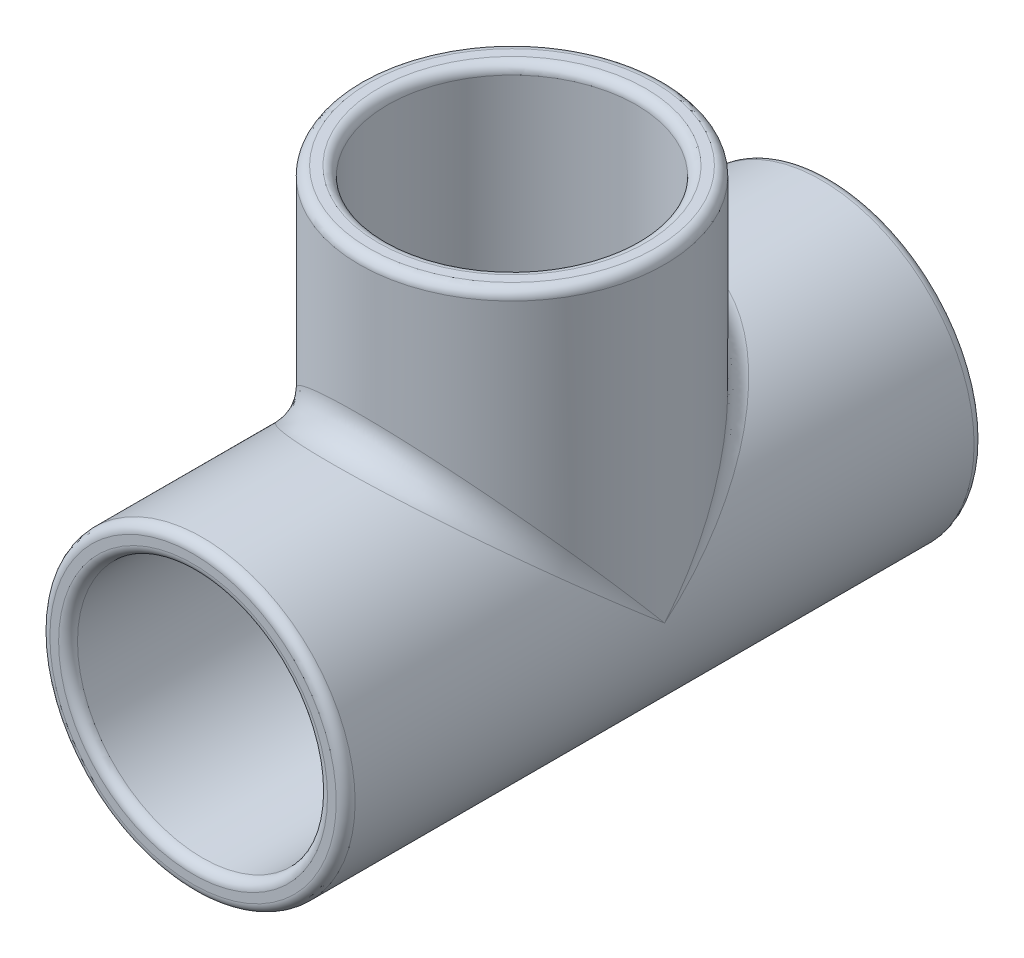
ISO-10303-21;
HEADER;
FILE_DESCRIPTION(('STEP AP214'),'2;1');
FILE_NAME('part.step','',(''),(''),'','','');
FILE_SCHEMA(('AUTOMOTIVE_DESIGN { 1 0 10303 214 1 1 1 1 }'));
ENDSEC;
DATA;
#1=APPLICATION_CONTEXT('core data for automotive mechanical design processes');
#2=APPLICATION_PROTOCOL_DEFINITION('international standard','automotive_design',2000,#1);
#3=PRODUCT_CONTEXT('',#1,'mechanical');
#4=PRODUCT('Part','Part','',(#3));
#5=PRODUCT_RELATED_PRODUCT_CATEGORY('part','',(#4));
#6=PRODUCT_DEFINITION_FORMATION('','',#4);
#7=PRODUCT_DEFINITION_CONTEXT('part definition',#1,'design');
#8=PRODUCT_DEFINITION('design','',#6,#7);
#9=PRODUCT_DEFINITION_SHAPE('','',#8);
#10=(LENGTH_UNIT() NAMED_UNIT(*) SI_UNIT(.MILLI.,.METRE.));
#11=(NAMED_UNIT(*) PLANE_ANGLE_UNIT() SI_UNIT($,.RADIAN.));
#12=(NAMED_UNIT(*) SI_UNIT($,.STERADIAN.) SOLID_ANGLE_UNIT());
#13=UNCERTAINTY_MEASURE_WITH_UNIT(LENGTH_MEASURE(1.E-05),#10,'distance_accuracy_value','');
#14=(GEOMETRIC_REPRESENTATION_CONTEXT(3) GLOBAL_UNCERTAINTY_ASSIGNED_CONTEXT((#13)) GLOBAL_UNIT_ASSIGNED_CONTEXT((#10,
#11,#12)) REPRESENTATION_CONTEXT('',''));
#15=CARTESIAN_POINT('',(0.,0.,0.));
#16=DIRECTION('',(0.,0.,1.));
#17=DIRECTION('',(1.,0.,0.));
#18=AXIS2_PLACEMENT_3D('',#15,#16,#17);
#19=CARTESIAN_POINT('',(0.,42.9895,42.8625));
#20=DIRECTION('',(0.,-1.,0.));
#21=DIRECTION('',(0.,0.,-1.));
#22=AXIS2_PLACEMENT_3D('',#19,#20,#21);
#23=CYLINDRICAL_SURFACE('',#22,13.8200475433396);
#24=CARTESIAN_POINT('',(0.,14.3478522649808,29.0424524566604));
#25=CARTESIAN_POINT('',(-0.312319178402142,14.3478488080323,29.0424559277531));
#26=CARTESIAN_POINT('',(-0.62473009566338,14.3376307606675,29.0530634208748));
#27=CARTESIAN_POINT('',(-1.24694819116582,14.2969685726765,29.0952856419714));
#28=CARTESIAN_POINT('',(-1.55675353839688,14.2665112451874,29.1269140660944));
#29=CARTESIAN_POINT('',(-2.17174254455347,14.1859363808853,29.2106221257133));
#30=CARTESIAN_POINT('',(-2.47691363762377,14.1357728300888,29.262749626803));
#31=CARTESIAN_POINT('',(-3.07951935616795,14.016838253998,29.3864141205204));
#32=CARTESIAN_POINT('',(-3.37695505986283,13.948069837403,29.4579483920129));
#33=CARTESIAN_POINT('',(-3.96009319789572,13.7937971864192,29.6185510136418));
#34=CARTESIAN_POINT('',(-4.2458652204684,13.7084182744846,29.7074880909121));
#35=CARTESIAN_POINT('',(-4.8064825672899,13.5220510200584,29.9018105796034));
#36=CARTESIAN_POINT('',(-5.08132776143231,13.4210624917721,30.0071961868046));
#37=CARTESIAN_POINT('',(-5.61891187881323,13.2050211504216,30.2329116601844));
#38=CARTESIAN_POINT('',(-5.88165562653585,13.0899740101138,30.3532354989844));
#39=CARTESIAN_POINT('',(-6.3944733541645,12.8472601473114,30.6074451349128));
#40=CARTESIAN_POINT('',(-6.64454438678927,12.7195905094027,30.7413340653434));
#41=CARTESIAN_POINT('',(-7.2311272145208,12.3985712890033,31.0785668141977));
#42=CARTESIAN_POINT('',(-7.56118582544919,12.1997072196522,31.287928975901));
#43=CARTESIAN_POINT('',(-8.19473446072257,11.7835042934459,31.7274732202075));
#44=CARTESIAN_POINT('',(-8.49821480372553,11.5661587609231,31.9576628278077));
#45=CARTESIAN_POINT('',(-9.0793964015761,11.1157953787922,32.4365509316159));
#46=CARTESIAN_POINT('',(-9.35702917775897,10.8827385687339,32.685295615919));
#47=CARTESIAN_POINT('',(-9.8860529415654,10.4045169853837,33.1983675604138));
#48=CARTESIAN_POINT('',(-10.1374454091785,10.1593528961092,33.4626939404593));
#49=CARTESIAN_POINT('',(-10.6960113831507,9.57448578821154,34.0975837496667));
#50=CARTESIAN_POINT('',(-10.9930084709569,9.23103130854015,34.4736598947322));
#51=CARTESIAN_POINT('',(-11.5428974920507,8.5334388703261,35.2479717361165));
#52=CARTESIAN_POINT('',(-11.7957600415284,8.17929397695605,35.6462219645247));
#53=CARTESIAN_POINT('',(-12.1426976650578,7.64596130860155,36.2592035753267));
#54=CARTESIAN_POINT('',(-12.2528907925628,7.46794551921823,36.4659948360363));
#55=CARTESIAN_POINT('',(-12.4627282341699,7.11223399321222,36.8851200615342));
#56=CARTESIAN_POINT('',(-12.5623735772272,6.93453822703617,37.0974534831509));
#57=CARTESIAN_POINT('',(-12.7511319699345,6.581004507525,37.5279387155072));
#58=CARTESIAN_POINT('',(-12.8402534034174,6.40516517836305,37.7460857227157));
#59=CARTESIAN_POINT('',(-13.0080562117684,6.05711184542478,38.189136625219));
#60=CARTESIAN_POINT('',(-13.0867399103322,5.8848970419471,38.4140390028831));
#61=CARTESIAN_POINT('',(-13.2094115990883,5.60246640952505,38.7966463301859));
#62=CARTESIAN_POINT('',(-13.256299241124,5.49048891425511,38.9521229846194));
#63=CARTESIAN_POINT('',(-13.3452353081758,5.27063640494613,39.2673313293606));
#64=CARTESIAN_POINT('',(-13.3872835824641,5.16276151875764,39.4270631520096));
#65=CARTESIAN_POINT('',(-13.4663687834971,4.95281128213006,39.7514713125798));
#66=CARTESIAN_POINT('',(-13.5034072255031,4.85073418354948,39.9161461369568));
#67=CARTESIAN_POINT('',(-13.5722055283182,4.65477225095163,40.2513318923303));
#68=CARTESIAN_POINT('',(-13.603966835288,4.56088517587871,40.4218412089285));
#69=CARTESIAN_POINT('',(-13.6727558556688,4.35118560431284,40.8355236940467));
#70=CARTESIAN_POINT('',(-13.7072399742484,4.24049009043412,41.0818124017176));
#71=CARTESIAN_POINT('',(-13.7635484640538,4.05404063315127,41.5885776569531));
#72=CARTESIAN_POINT('',(-13.7854122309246,3.97817810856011,41.849007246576));
#73=CARTESIAN_POINT('',(-13.811416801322,3.88684168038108,42.3291869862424));
#74=CARTESIAN_POINT('',(-13.8181726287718,3.86250877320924,42.5470298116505));
#75=CARTESIAN_POINT('',(-13.8212385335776,3.85153096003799,42.9835297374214));
#76=CARTESIAN_POINT('',(-13.8175602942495,3.86484390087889,43.2021856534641));
#77=CARTESIAN_POINT('',(-13.7981073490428,3.93376931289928,43.6857690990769));
#78=CARTESIAN_POINT('',(-13.7796423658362,3.99876334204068,43.949212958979));
#79=CARTESIAN_POINT('',(-13.74212557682,4.12513610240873,44.3337480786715));
#80=CARTESIAN_POINT('',(-13.7279292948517,4.17224833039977,44.4604975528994));
#81=CARTESIAN_POINT('',(-13.696515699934,4.27424651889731,44.7104672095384));
#82=CARTESIAN_POINT('',(-13.6792986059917,4.32913191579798,44.8336876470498));
#83=CARTESIAN_POINT('',(-13.6359078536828,4.46423748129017,45.1169522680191));
#84=CARTESIAN_POINT('',(-13.6086557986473,4.54683059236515,45.2756867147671));
#85=CARTESIAN_POINT('',(-13.5495785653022,4.71997925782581,45.5879086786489));
#86=CARTESIAN_POINT('',(-13.5177511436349,4.8105387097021,45.741393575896));
#87=CARTESIAN_POINT('',(-13.4157026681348,5.0910875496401,46.195556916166));
#88=CARTESIAN_POINT('',(-13.3389943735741,5.28969217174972,46.4894449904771));
#89=CARTESIAN_POINT('',(-13.1689495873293,5.69995614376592,47.0652270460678));
#90=CARTESIAN_POINT('',(-13.0755237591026,5.91168142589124,47.3470459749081));
#91=CARTESIAN_POINT('',(-12.8727173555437,6.34116483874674,47.8996996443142));
#92=CARTESIAN_POINT('',(-12.7633508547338,6.55891751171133,48.1705438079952));
#93=CARTESIAN_POINT('',(-12.5500540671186,6.95688892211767,48.6544219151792));
#94=CARTESIAN_POINT('',(-12.4487823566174,7.13669522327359,48.8689757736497));
#95=CARTESIAN_POINT('',(-12.2354390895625,7.49657748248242,49.2924251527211));
#96=CARTESIAN_POINT('',(-12.123366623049,7.6766534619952,49.5013201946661));
#97=CARTESIAN_POINT('',(-11.7705739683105,8.21576947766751,50.1201221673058));
#98=CARTESIAN_POINT('',(-11.5133706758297,8.57352278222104,50.5219368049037));
#99=CARTESIAN_POINT('',(-10.9547420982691,9.2766135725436,51.3014721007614));
#100=CARTESIAN_POINT('',(-10.6534962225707,9.62199466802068,51.6792819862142));
#101=CARTESIAN_POINT('',(-10.0044044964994,10.2951988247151,52.409432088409));
#102=CARTESIAN_POINT('',(-9.65659276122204,10.6230344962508,52.7617906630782));
#103=CARTESIAN_POINT('',(-9.04504011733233,11.1421291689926,53.3164796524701));
#104=CARTESIAN_POINT('',(-8.79531147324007,11.3405429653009,53.5276490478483));
#105=CARTESIAN_POINT('',(-8.27559366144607,11.7251817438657,53.9357744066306));
#106=CARTESIAN_POINT('',(-8.00560588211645,11.9114075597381,54.1327313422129));
#107=CARTESIAN_POINT('',(-7.44559791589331,12.2692408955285,54.5102781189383));
#108=CARTESIAN_POINT('',(-7.15559332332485,12.4408595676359,54.6908804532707));
#109=CARTESIAN_POINT('',(-6.55574597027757,12.7671279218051,55.0335785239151));
#110=CARTESIAN_POINT('',(-6.24590663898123,12.9217805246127,55.1956774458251));
#111=CARTESIAN_POINT('',(-5.66412970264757,13.1856585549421,55.4718532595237));
#112=CARTESIAN_POINT('',(-5.39525474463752,13.2980710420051,55.5893431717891));
#113=CARTESIAN_POINT('',(-4.84558561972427,13.5080597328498,55.8086006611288));
#114=CARTESIAN_POINT('',(-4.56479397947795,13.6056390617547,55.9103715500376));
#115=CARTESIAN_POINT('',(-3.99257810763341,13.7844109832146,56.0966801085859));
#116=CARTESIAN_POINT('',(-3.70115808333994,13.8656099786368,56.1812245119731));
#117=CARTESIAN_POINT('',(-3.10920704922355,14.0102287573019,56.3317164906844));
#118=CARTESIAN_POINT('',(-2.80867596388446,14.0736483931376,56.3976639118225));
#119=CARTESIAN_POINT('',(-2.19858037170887,14.1818085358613,56.5100924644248));
#120=CARTESIAN_POINT('',(-1.88896989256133,14.2264251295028,56.5564444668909));
#121=CARTESIAN_POINT('',(-1.265071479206,14.2954170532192,56.6281054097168));
#122=CARTESIAN_POINT('',(-0.950783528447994,14.3197923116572,56.6534142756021));
#123=CARTESIAN_POINT('',(-0.320377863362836,14.3477434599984,56.6824351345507));
#124=CARTESIAN_POINT('',(-0.00426071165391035,14.3513254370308,56.68615344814));
#125=CARTESIAN_POINT('',(0.627014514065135,14.3376207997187,56.6719251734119));
#126=CARTESIAN_POINT('',(0.942172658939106,14.3203357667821,56.6539802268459));
#127=CARTESIAN_POINT('',(1.53600068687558,14.2681791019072,56.5998152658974));
#128=CARTESIAN_POINT('',(1.81504579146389,14.2353312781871,56.5656981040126));
#129=CARTESIAN_POINT('',(2.36825024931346,14.1538126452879,56.4809945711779));
#130=CARTESIAN_POINT('',(2.64241001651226,14.1051431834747,56.430409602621));
#131=CARTESIAN_POINT('',(3.18424140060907,13.9927854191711,56.3135650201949));
#132=CARTESIAN_POINT('',(3.451912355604,13.9290955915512,56.2473038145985));
#133=CARTESIAN_POINT('',(3.97937483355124,13.787676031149,56.1000707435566));
#134=CARTESIAN_POINT('',(4.23916587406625,13.7099454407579,56.0190979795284));
#135=CARTESIAN_POINT('',(4.76302202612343,13.5371510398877,55.8389398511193));
#136=CARTESIAN_POINT('',(5.0266083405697,13.4413966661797,55.7390269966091));
#137=CARTESIAN_POINT('',(5.54294537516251,13.2368340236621,55.5253424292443));
#138=CARTESIAN_POINT('',(5.79569255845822,13.1280215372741,55.4115662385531));
#139=CARTESIAN_POINT('',(6.28961183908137,12.8986739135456,55.1714359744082));
#140=CARTESIAN_POINT('',(6.53078364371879,12.7781384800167,55.0450815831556));
#141=CARTESIAN_POINT('',(7.00113561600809,12.5266164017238,54.7809975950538));
#142=CARTESIAN_POINT('',(7.23031448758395,12.3956286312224,54.6432667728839));
#143=CARTESIAN_POINT('',(7.79923783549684,12.0497516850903,54.2789020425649));
#144=CARTESIAN_POINT('',(8.13044438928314,11.8283500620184,54.045044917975));
#145=CARTESIAN_POINT('',(8.763310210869,11.3674364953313,53.5563330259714));
#146=CARTESIAN_POINT('',(9.06496457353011,11.1279215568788,53.3014747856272));
#147=CARTESIAN_POINT('',(9.64008812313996,10.6336147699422,52.7728706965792));
#148=CARTESIAN_POINT('',(9.91346325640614,10.3787761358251,52.4990665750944));
#149=CARTESIAN_POINT('',(10.4315345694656,9.85793609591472,51.9357148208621));
#150=CARTESIAN_POINT('',(10.6762358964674,9.59193670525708,51.6461700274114));
#151=CARTESIAN_POINT('',(11.2037266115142,8.97472351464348,50.9682839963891));
#152=CARTESIAN_POINT('',(11.4774875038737,8.62083447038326,50.575309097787));
#153=CARTESIAN_POINT('',(11.8549906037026,8.08504391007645,49.9695058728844));
#154=CARTESIAN_POINT('',(11.9753668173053,7.90550706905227,49.7647148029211));
#155=CARTESIAN_POINT('',(12.2052070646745,7.54581343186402,49.34963555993));
#156=CARTESIAN_POINT('',(12.3146722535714,7.36565670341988,49.1393479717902));
#157=CARTESIAN_POINT('',(12.5227168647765,7.00610589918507,48.7132634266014));
#158=CARTESIAN_POINT('',(12.6213077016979,6.82671121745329,48.4974725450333));
#159=CARTESIAN_POINT('',(12.8078073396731,6.47003901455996,48.0596539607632));
#160=CARTESIAN_POINT('',(12.8957176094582,6.29276120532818,47.8376271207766));
#161=CARTESIAN_POINT('',(13.060739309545,5.94267106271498,47.3866992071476));
#162=CARTESIAN_POINT('',(13.1378660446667,5.76985269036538,47.1578084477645));
#163=CARTESIAN_POINT('',(13.2812865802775,5.43156834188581,46.6914288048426));
#164=CARTESIAN_POINT('',(13.3475852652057,5.26609907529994,46.4539438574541));
#165=CARTESIAN_POINT('',(13.4467739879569,5.00568662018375,46.0567460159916));
#166=CARTESIAN_POINT('',(13.4830235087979,4.90705286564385,45.9002982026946));
#167=CARTESIAN_POINT('',(13.5507827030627,4.71670836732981,45.5821472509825));
#168=CARTESIAN_POINT('',(13.5822911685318,4.62499939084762,45.4204427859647));
#169=CARTESIAN_POINT('',(13.6401020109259,4.45160615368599,45.0916405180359));
#170=CARTESIAN_POINT('',(13.6664254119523,4.36988194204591,44.9245678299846));
#171=CARTESIAN_POINT('',(13.7135069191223,4.21980745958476,44.5838383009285));
#172=CARTESIAN_POINT('',(13.7342694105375,4.15144666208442,44.4101867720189));
#173=CARTESIAN_POINT('',(13.7734286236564,4.01985695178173,44.0171975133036));
#174=CARTESIAN_POINT('',(13.7903181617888,3.96101003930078,43.7961652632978));
#175=CARTESIAN_POINT('',(13.8133643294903,3.87991914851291,43.3471332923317));
#176=CARTESIAN_POINT('',(13.8195484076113,3.85758156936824,43.1191529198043));
#177=CARTESIAN_POINT('',(13.8204896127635,3.85421178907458,42.6620179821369));
#178=CARTESIAN_POINT('',(13.8152055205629,3.87332858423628,42.4328621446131));
#179=CARTESIAN_POINT('',(13.7937801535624,3.94890687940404,41.9811199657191));
#180=CARTESIAN_POINT('',(13.7776115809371,4.00546226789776,41.7585516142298));
#181=CARTESIAN_POINT('',(13.7396037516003,4.13373354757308,41.3627575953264));
#182=CARTESIAN_POINT('',(13.7192994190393,4.20091801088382,41.1878357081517));
#183=CARTESIAN_POINT('',(13.6730388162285,4.3491267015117,40.8446499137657));
#184=CARTESIAN_POINT('',(13.647077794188,4.43016255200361,40.6763917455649));
#185=CARTESIAN_POINT('',(13.5899137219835,4.60254201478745,40.3452955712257));
#186=CARTESIAN_POINT('',(13.5586882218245,4.69392919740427,40.1824845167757));
#187=CARTESIAN_POINT('',(13.4914360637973,4.88386985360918,39.8622309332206));
#188=CARTESIAN_POINT('',(13.4554107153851,4.98242136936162,39.7047869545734));
#189=CARTESIAN_POINT('',(13.3612591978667,5.23090718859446,39.3234642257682));
#190=CARTESIAN_POINT('',(13.3005579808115,5.383736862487,39.1021151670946));
#191=CARTESIAN_POINT('',(13.1697898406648,5.69616136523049,38.667035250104));
#192=CARTESIAN_POINT('',(13.0997192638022,5.85575881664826,38.4533074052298));
#193=CARTESIAN_POINT('',(12.9502853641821,6.17922009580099,38.031989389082));
#194=CARTESIAN_POINT('',(12.8709105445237,6.34308900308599,37.8244072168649));
#195=CARTESIAN_POINT('',(12.7029610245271,6.67307600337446,37.4147952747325));
#196=CARTESIAN_POINT('',(12.6143851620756,6.83919437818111,37.2127662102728));
#197=CARTESIAN_POINT('',(12.4279258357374,7.17244786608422,36.8136220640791));
#198=CARTESIAN_POINT('',(12.3300356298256,7.33958363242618,36.6165106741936));
#199=CARTESIAN_POINT('',(12.1249082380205,7.67371643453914,36.2270850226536));
#200=CARTESIAN_POINT('',(12.0176702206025,7.84071345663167,36.0347711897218));
#201=CARTESIAN_POINT('',(11.6819318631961,8.33990196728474,35.4651695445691));
#202=CARTESIAN_POINT('',(11.4392177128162,8.67063418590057,35.0948155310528));
#203=CARTESIAN_POINT('',(10.9513425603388,9.27677857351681,34.4239643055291));
#204=CARTESIAN_POINT('',(10.7112448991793,9.55347242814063,34.1209286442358));
#205=CARTESIAN_POINT('',(10.201157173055,10.0963341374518,33.5307126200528));
#206=CARTESIAN_POINT('',(9.93116146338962,10.3624999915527,33.2435352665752));
#207=CARTESIAN_POINT('',(9.3612373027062,10.8800706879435,32.6880767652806));
#208=CARTESIAN_POINT('',(9.06138592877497,11.1315110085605,32.4197498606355));
#209=CARTESIAN_POINT('',(8.43052614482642,11.6165981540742,31.9041317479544));
#210=CARTESIAN_POINT('',(8.099516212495,11.8502441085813,31.6568415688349));
#211=CARTESIAN_POINT('',(7.50057695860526,12.2348768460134,31.2509527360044));
#212=CARTESIAN_POINT('',(7.23993596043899,12.3910772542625,31.0865085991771));
#213=CARTESIAN_POINT('',(6.70242795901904,12.6898706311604,30.7725042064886));
#214=CARTESIAN_POINT('',(6.42556523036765,12.8324671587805,30.622940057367));
#215=CARTESIAN_POINT('',(5.85620761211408,13.1020949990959,30.3405391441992));
#216=CARTESIAN_POINT('',(5.56371585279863,13.2291294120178,30.2076990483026));
#217=CARTESIAN_POINT('',(4.96408841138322,13.4656040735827,29.9606933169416));
#218=CARTESIAN_POINT('',(4.65695535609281,13.5750474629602,29.846524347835));
#219=CARTESIAN_POINT('',(4.07646899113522,13.7594209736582,29.6543535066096));
#220=CARTESIAN_POINT('',(3.80492026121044,13.8370644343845,29.5734967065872));
#221=CARTESIAN_POINT('',(3.25367514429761,13.9769552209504,29.4278978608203));
#222=CARTESIAN_POINT('',(2.97398027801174,14.0392054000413,29.363152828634));
#223=CARTESIAN_POINT('',(2.40866357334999,14.1471495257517,29.2509268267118));
#224=CARTESIAN_POINT('',(2.12305618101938,14.1928797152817,29.2034080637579));
#225=CARTESIAN_POINT('',(1.54732923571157,14.2671225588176,29.1262797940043));
#226=CARTESIAN_POINT('',(1.2572122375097,14.2956446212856,29.0966605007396));
#227=CARTESIAN_POINT('',(0.80543338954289,14.3261317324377,29.0650035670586));
#228=CARTESIAN_POINT('',(0.644592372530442,14.3342708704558,29.0565529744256));
#229=CARTESIAN_POINT('',(0.32250909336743,14.3451324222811,29.0452761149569));
#230=CARTESIAN_POINT('',(0.161266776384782,14.3478540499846,29.0424506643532));
#231=CARTESIAN_POINT('',(0.,14.3478522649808,29.0424524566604));
#232=B_SPLINE_CURVE_WITH_KNOTS('',3,(#24,#25,#26,#27,#28,#29,#30,#31,#32,#33,#34,#35,#36,#37,
#38,#39,#40,#41,#42,#43,#44,#45,#46,#47,#48,#49,#50,#51,#52,#53,#54,#55,#56,#57,#58,#59,#60,#61,
#62,#63,#64,#65,#66,#67,#68,#69,#70,#71,#72,#73,#74,#75,#76,#77,#78,#79,#80,#81,#82,#83,#84,#85,
#86,#87,#88,#89,#90,#91,#92,#93,#94,#95,#96,#97,#98,#99,#100,#101,#102,#103,#104,#105,#106,#107,
#108,#109,#110,#111,#112,#113,#114,#115,#116,#117,#118,#119,#120,#121,#122,#123,#124,#125,#126,
#127,#128,#129,#130,#131,#132,#133,#134,#135,#136,#137,#138,#139,#140,#141,#142,#143,#144,#145,
#146,#147,#148,#149,#150,#151,#152,#153,#154,#155,#156,#157,#158,#159,#160,#161,#162,#163,#164,
#165,#166,#167,#168,#169,#170,#171,#172,#173,#174,#175,#176,#177,#178,#179,#180,#181,#182,#183,
#184,#185,#186,#187,#188,#189,#190,#191,#192,#193,#194,#195,#196,#197,#198,#199,#200,#201,#202,
#203,#204,#205,#206,#207,#208,#209,#210,#211,#212,#213,#214,#215,#216,#217,#218,#219,#220,#221,
#222,#223,#224,#225,#226,#227,#228,#229,#230,#231),.UNSPECIFIED.,.T.,.F.,(4,2,2,2,2,2,2,2,2,2,2,
2,2,2,2,2,2,2,2,2,2,2,2,2,2,2,2,2,2,2,2,2,2,2,2,2,2,2,2,2,2,2,2,2,2,2,2,2,2,2,2,2,2,2,2,2,2,2,2,
2,2,2,2,2,2,2,2,2,2,2,2,2,2,2,2,2,2,2,2,2,2,2,2,2,2,2,2,2,2,2,2,2,2,2,2,2,2,2,2,2,2,2,2,4),(0.,
0.936773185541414,1.87415732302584,2.81374338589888,3.7531977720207,4.68582134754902,
5.61845602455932,6.55071561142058,7.48319102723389,8.79685399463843,10.1109935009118,
11.4285210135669,12.7459741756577,14.5122866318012,16.279770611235,17.1623863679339,
18.044915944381,18.9267376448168,19.8083626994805,20.4000139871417,20.9916836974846,
21.5831740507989,22.1745020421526,22.9892293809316,23.8013995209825,24.4560408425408,
25.1099494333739,25.9207322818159,26.3284338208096,26.7361058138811,27.2787012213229,
27.821563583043,28.9089787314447,30.0023885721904,31.0948387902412,31.987660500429,
32.8805574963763,34.6672121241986,36.4467816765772,38.2250545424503,39.3717738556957,
40.5184146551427,41.6641720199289,42.8097318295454,43.7515053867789,44.6930802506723,
45.6342863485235,46.5755002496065,47.5228233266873,48.4701497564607,49.4171988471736,
50.3641761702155,51.2123171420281,52.0603859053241,52.9085408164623,53.756747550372,
54.6490078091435,55.5415570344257,56.4341288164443,57.3267968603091,58.7105735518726,
60.0945795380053,61.4830498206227,62.8712704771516,64.6552398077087,65.5483421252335,
66.4413497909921,67.3334109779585,68.2253493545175,69.1160086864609,70.0062651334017,
70.5714574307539,71.1367934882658,71.6997878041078,72.2623368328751,72.9477543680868,
73.6314118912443,74.3175307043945,75.0053767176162,75.5699894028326,76.135078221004,
76.7026407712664,77.270048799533,78.0968235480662,78.9239216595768,79.7520527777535,
80.5802886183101,81.4091285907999,82.2380423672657,83.8941807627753,85.3193178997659,
86.7447245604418,88.1665422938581,89.5884295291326,90.6240889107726,91.659476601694,
92.6946576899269,93.7296537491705,94.6100936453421,95.4903702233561,96.3687036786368,
97.2465564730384,97.7301914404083,98.2138965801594),.UNSPECIFIED.);
#233=CARTESIAN_POINT('',(0.,14.3478522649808,29.0424524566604));
#234=VERTEX_POINT('',#233);
#235=EDGE_CURVE('E134',#234,#234,#232,.T.);
#236=ORIENTED_EDGE('',*,*,#235,.F.);
#237=EDGE_LOOP('',(#236));
#238=FACE_BOUND('',#237,.T.);
#239=CARTESIAN_POINT('',(0.,17.5895,42.8625));
#240=DIRECTION('',(0.,1.,0.));
#241=DIRECTION('',(0.,0.,1.));
#242=AXIS2_PLACEMENT_3D('',#239,#240,#241);
#243=CIRCLE('',#242,13.8200475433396);
#244=CARTESIAN_POINT('',(0.,17.5895,56.6825475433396));
#245=VERTEX_POINT('',#244);
#246=EDGE_CURVE('E74',#245,#245,#243,.T.);
#247=ORIENTED_EDGE('',*,*,#246,.T.);
#248=EDGE_LOOP('',(#247));
#249=FACE_BOUND('',#248,.T.);
#250=ADVANCED_FACE('F34',(#238,#249),#23,.F.);
#251=CARTESIAN_POINT('',(0.,0.,73.9394));
#252=DIRECTION('',(0.,0.,-1.));
#253=DIRECTION('',(-1.,0.,0.));
#254=AXIS2_PLACEMENT_3D('',#251,#252,#253);
#255=CYLINDRICAL_SURFACE('',#254,14.3478522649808);
#256=CARTESIAN_POINT('',(0.,0.,25.4));
#257=DIRECTION('',(0.,0.,-1.));
#258=DIRECTION('',(-1.,0.,0.));
#259=AXIS2_PLACEMENT_3D('',#256,#257,#258);
#260=CIRCLE('',#259,14.3478522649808);
#261=CARTESIAN_POINT('',(-14.3478522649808,0.,25.4));
#262=VERTEX_POINT('',#261);
#263=EDGE_CURVE('E68',#262,#262,#260,.T.);
#264=ORIENTED_EDGE('',*,*,#263,.T.);
#265=EDGE_LOOP('',(#264));
#266=FACE_BOUND('',#265,.T.);
#267=CARTESIAN_POINT('',(0.,0.,60.325));
#268=DIRECTION('',(0.,0.,1.));
#269=DIRECTION('',(1.,0.,0.));
#270=AXIS2_PLACEMENT_3D('',#267,#268,#269);
#271=CIRCLE('',#270,14.3478522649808);
#272=CARTESIAN_POINT('',(14.3478522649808,0.,60.325));
#273=VERTEX_POINT('',#272);
#274=EDGE_CURVE('E140',#273,#273,#271,.T.);
#275=ORIENTED_EDGE('',*,*,#274,.T.);
#276=EDGE_LOOP('',(#275));
#277=FACE_BOUND('',#276,.T.);
#278=ORIENTED_EDGE('',*,*,#235,.T.);
#279=EDGE_LOOP('',(#278));
#280=FACE_BOUND('',#279,.T.);
#281=ADVANCED_FACE('F118',(#266,#277,#280),#255,.F.);
#282=CARTESIAN_POINT('',(0.,0.,85.725));
#283=DIRECTION('',(0.,0.,-1.));
#284=DIRECTION('',(-1.,0.,0.));
#285=AXIS2_PLACEMENT_3D('',#282,#283,#284);
#286=CYLINDRICAL_SURFACE('',#285,20.5105);
#287=CARTESIAN_POINT('',(0.,0.,1.26999999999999));
#288=DIRECTION('',(0.,0.,1.));
#289=DIRECTION('',(1.,0.,0.));
#290=AXIS2_PLACEMENT_3D('',#287,#288,#289);
#291=CIRCLE('',#290,20.5105);
#292=CARTESIAN_POINT('',(20.5105,0.,1.26999999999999));
#293=VERTEX_POINT('',#292);
#294=EDGE_CURVE('E188',#293,#293,#291,.T.);
#295=ORIENTED_EDGE('',*,*,#294,.T.);
#296=EDGE_LOOP('',(#295));
#297=FACE_BOUND('',#296,.T.);
#298=CARTESIAN_POINT('',(0.,0.,84.455));
#299=DIRECTION('',(0.,0.,1.));
#300=DIRECTION('',(1.,0.,0.));
#301=AXIS2_PLACEMENT_3D('',#298,#299,#300);
#302=CIRCLE('',#301,20.5105);
#303=CARTESIAN_POINT('',(20.5105,0.,84.455));
#304=VERTEX_POINT('',#303);
#305=EDGE_CURVE('E185',#304,#304,#302,.F.);
#306=ORIENTED_EDGE('',*,*,#305,.T.);
#307=EDGE_LOOP('',(#306));
#308=FACE_BOUND('',#307,.T.);
#309=CARTESIAN_POINT('',(0.,0.,42.8625));
#310=DIRECTION('',(0.,0.764445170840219,0.644688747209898));
#311=DIRECTION('',(0.,-0.644688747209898,0.764445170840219));
#312=AXIS2_PLACEMENT_3D('',#309,#310,#311);
#313=ELLIPSE('',#312,31.8145773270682,20.5105);
#314=CARTESIAN_POINT('',(-20.5105,0.,42.8625));
#315=VERTEX_POINT('',#314);
#316=CARTESIAN_POINT('',(20.5105,0.,42.8625));
#317=VERTEX_POINT('',#316);
#318=EDGE_CURVE('E48',#315,#317,#313,.F.);
#319=ORIENTED_EDGE('',*,*,#318,.T.);
#320=CARTESIAN_POINT('',(0.,0.,42.8625));
#321=DIRECTION('',(0.,0.764445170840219,-0.644688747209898));
#322=DIRECTION('',(0.,-0.644688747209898,-0.764445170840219));
#323=AXIS2_PLACEMENT_3D('',#320,#321,#322);
#324=ELLIPSE('',#323,31.8145773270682,20.5105);
#325=EDGE_CURVE('E53',#317,#315,#324,.F.);
#326=ORIENTED_EDGE('',*,*,#325,.T.);
#327=EDGE_LOOP('',(#319,#326));
#328=FACE_BOUND('',#327,.T.);
#329=ADVANCED_FACE('F61',(#297,#308,#328),#286,.T.);
#330=CARTESIAN_POINT('',(0.,0.,85.725));
#331=DIRECTION('',(0.,0.,1.));
#332=DIRECTION('',(1.,0.,0.));
#333=AXIS2_PLACEMENT_3D('',#330,#331,#332);
#334=PLANE('',#333);
#335=CARTESIAN_POINT('',(0.,0.,85.725));
#336=DIRECTION('',(0.,0.,1.));
#337=DIRECTION('',(1.,0.,0.));
#338=AXIS2_PLACEMENT_3D('',#335,#336,#337);
#339=CIRCLE('',#338,18.0721);
#340=CARTESIAN_POINT('',(18.0721,0.,85.725));
#341=VERTEX_POINT('',#340);
#342=EDGE_CURVE('E42',#341,#341,#339,.F.);
#343=ORIENTED_EDGE('',*,*,#342,.T.);
#344=EDGE_LOOP('',(#343));
#345=FACE_BOUND('',#344,.T.);
#346=CARTESIAN_POINT('',(0.,0.,85.725));
#347=DIRECTION('',(0.,0.,1.));
#348=DIRECTION('',(1.,0.,0.));
#349=AXIS2_PLACEMENT_3D('',#346,#347,#348);
#350=CIRCLE('',#349,19.2405);
#351=CARTESIAN_POINT('',(19.2405,0.,85.725));
#352=VERTEX_POINT('',#351);
#353=EDGE_CURVE('E194',#352,#352,#350,.T.);
#354=ORIENTED_EDGE('',*,*,#353,.T.);
#355=EDGE_LOOP('',(#354));
#356=FACE_BOUND('',#355,.T.);
#357=ADVANCED_FACE('F108',(#345,#356),#334,.T.);
#358=CARTESIAN_POINT('',(0.,0.,0.));
#359=DIRECTION('',(0.,0.,1.));
#360=DIRECTION('',(1.,0.,0.));
#361=AXIS2_PLACEMENT_3D('',#358,#359,#360);
#362=PLANE('',#361);
#363=CARTESIAN_POINT('',(0.,0.,0.));
#364=DIRECTION('',(0.,0.,1.));
#365=DIRECTION('',(1.,0.,0.));
#366=AXIS2_PLACEMENT_3D('',#363,#364,#365);
#367=CIRCLE('',#366,18.0721);
#368=CARTESIAN_POINT('',(18.0721,0.,0.));
#369=VERTEX_POINT('',#368);
#370=EDGE_CURVE('E183',#369,#369,#367,.T.);
#371=ORIENTED_EDGE('',*,*,#370,.T.);
#372=EDGE_LOOP('',(#371));
#373=FACE_BOUND('',#372,.T.);
#374=CARTESIAN_POINT('',(0.,0.,0.));
#375=DIRECTION('',(0.,0.,1.));
#376=DIRECTION('',(1.,0.,0.));
#377=AXIS2_PLACEMENT_3D('',#374,#375,#376);
#378=CIRCLE('',#377,19.2405);
#379=CARTESIAN_POINT('',(19.2405,0.,0.));
#380=VERTEX_POINT('',#379);
#381=EDGE_CURVE('E180',#380,#380,#378,.F.);
#382=ORIENTED_EDGE('',*,*,#381,.T.);
#383=EDGE_LOOP('',(#382));
#384=FACE_BOUND('',#383,.T.);
#385=ADVANCED_FACE('F99',(#373,#384),#362,.F.);
#386=CARTESIAN_POINT('',(0.,42.9895,42.8625));
#387=DIRECTION('',(0.,-1.,0.));
#388=DIRECTION('',(0.,0.,-1.));
#389=AXIS2_PLACEMENT_3D('',#386,#387,#388);
#390=CYLINDRICAL_SURFACE('',#389,20.5105);
#391=CARTESIAN_POINT('',(0.,41.7195,42.8625));
#392=DIRECTION('',(0.,1.,0.));
#393=DIRECTION('',(0.,0.,1.));
#394=AXIS2_PLACEMENT_3D('',#391,#392,#393);
#395=CIRCLE('',#394,20.5105);
#396=CARTESIAN_POINT('',(0.,41.7195,63.373));
#397=VERTEX_POINT('',#396);
#398=EDGE_CURVE('E11',#397,#397,#395,.F.);
#399=ORIENTED_EDGE('',*,*,#398,.T.);
#400=EDGE_LOOP('',(#399));
#401=FACE_BOUND('',#400,.T.);
#402=CARTESIAN_POINT('',(0.,0.,42.8625));
#403=DIRECTION('',(0.,0.644688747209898,0.764445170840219));
#404=DIRECTION('',(0.,-0.764445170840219,0.644688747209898));
#405=AXIS2_PLACEMENT_3D('',#402,#403,#404);
#406=ELLIPSE('',#405,31.8145773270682,20.5105);
#407=EDGE_CURVE('E65',#317,#315,#406,.T.);
#408=ORIENTED_EDGE('',*,*,#407,.T.);
#409=CARTESIAN_POINT('',(0.,0.,42.8625));
#410=DIRECTION('',(0.,0.644688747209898,-0.764445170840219));
#411=DIRECTION('',(0.,-0.764445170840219,-0.644688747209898));
#412=AXIS2_PLACEMENT_3D('',#409,#410,#411);
#413=ELLIPSE('',#412,31.8145773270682,20.5105);
#414=EDGE_CURVE('E56',#315,#317,#413,.T.);
#415=ORIENTED_EDGE('',*,*,#414,.T.);
#416=EDGE_LOOP('',(#408,#415));
#417=FACE_BOUND('',#416,.T.);
#418=ADVANCED_FACE('F64',(#401,#417),#390,.T.);
#419=CARTESIAN_POINT('',(0.,42.9895,42.8625));
#420=DIRECTION('',(0.,1.,0.));
#421=DIRECTION('',(0.,0.,1.));
#422=AXIS2_PLACEMENT_3D('',#419,#420,#421);
#423=PLANE('',#422);
#424=CARTESIAN_POINT('',(0.,42.9895,42.8625));
#425=DIRECTION('',(0.,1.,0.));
#426=DIRECTION('',(0.,0.,1.));
#427=AXIS2_PLACEMENT_3D('',#424,#425,#426);
#428=CIRCLE('',#427,17.9705);
#429=CARTESIAN_POINT('',(0.,42.9895,60.833));
#430=VERTEX_POINT('',#429);
#431=EDGE_CURVE('E172',#430,#430,#428,.F.);
#432=ORIENTED_EDGE('',*,*,#431,.T.);
#433=EDGE_LOOP('',(#432));
#434=FACE_BOUND('',#433,.T.);
#435=CARTESIAN_POINT('',(0.,42.9895,42.8625));
#436=DIRECTION('',(0.,1.,0.));
#437=DIRECTION('',(0.,0.,1.));
#438=AXIS2_PLACEMENT_3D('',#435,#436,#437);
#439=CIRCLE('',#438,19.2405);
#440=CARTESIAN_POINT('',(0.,42.9895,62.103));
#441=VERTEX_POINT('',#440);
#442=EDGE_CURVE('E170',#441,#441,#439,.T.);
#443=ORIENTED_EDGE('',*,*,#442,.T.);
#444=EDGE_LOOP('',(#443));
#445=FACE_BOUND('',#444,.T.);
#446=ADVANCED_FACE('F98',(#434,#445),#423,.T.);
#447=CARTESIAN_POINT('',(0.,0.,85.725));
#448=DIRECTION('',(0.,0.,-1.));
#449=DIRECTION('',(-1.,0.,0.));
#450=AXIS2_PLACEMENT_3D('',#447,#448,#449);
#451=CYLINDRICAL_SURFACE('',#450,16.8021);
#452=CARTESIAN_POINT('',(0.,0.,84.455));
#453=DIRECTION('',(0.,0.,1.));
#454=DIRECTION('',(1.,0.,0.));
#455=AXIS2_PLACEMENT_3D('',#452,#453,#454);
#456=CIRCLE('',#455,16.8021);
#457=CARTESIAN_POINT('',(16.8021,0.,84.455));
#458=VERTEX_POINT('',#457);
#459=EDGE_CURVE('E191',#458,#458,#456,.T.);
#460=ORIENTED_EDGE('',*,*,#459,.T.);
#461=EDGE_LOOP('',(#460));
#462=FACE_BOUND('',#461,.T.);
#463=CARTESIAN_POINT('',(0.,0.,60.325));
#464=DIRECTION('',(0.,0.,1.));
#465=DIRECTION('',(1.,0.,0.));
#466=AXIS2_PLACEMENT_3D('',#463,#464,#465);
#467=CIRCLE('',#466,16.8021);
#468=CARTESIAN_POINT('',(16.8021,0.,60.325));
#469=VERTEX_POINT('',#468);
#470=EDGE_CURVE('E139',#469,#469,#467,.T.);
#471=ORIENTED_EDGE('',*,*,#470,.F.);
#472=EDGE_LOOP('',(#471));
#473=FACE_BOUND('',#472,.T.);
#474=ADVANCED_FACE('F102',(#462,#473),#451,.F.);
#475=CARTESIAN_POINT('',(0.,0.,25.4));
#476=DIRECTION('',(0.,0.,-1.));
#477=DIRECTION('',(-1.,0.,0.));
#478=AXIS2_PLACEMENT_3D('',#475,#476,#477);
#479=CYLINDRICAL_SURFACE('',#478,16.8021);
#480=CARTESIAN_POINT('',(0.,0.,1.27));
#481=DIRECTION('',(0.,0.,1.));
#482=DIRECTION('',(1.,0.,0.));
#483=AXIS2_PLACEMENT_3D('',#480,#481,#482);
#484=CIRCLE('',#483,16.8021);
#485=CARTESIAN_POINT('',(16.8021,0.,1.27));
#486=VERTEX_POINT('',#485);
#487=EDGE_CURVE('E177',#486,#486,#484,.F.);
#488=ORIENTED_EDGE('',*,*,#487,.T.);
#489=EDGE_LOOP('',(#488));
#490=FACE_BOUND('',#489,.T.);
#491=CARTESIAN_POINT('',(0.,0.,25.4));
#492=DIRECTION('',(0.,0.,-1.));
#493=DIRECTION('',(-1.,0.,0.));
#494=AXIS2_PLACEMENT_3D('',#491,#492,#493);
#495=CIRCLE('',#494,16.8021);
#496=CARTESIAN_POINT('',(-16.8021,0.,25.4));
#497=VERTEX_POINT('',#496);
#498=EDGE_CURVE('E71',#497,#497,#495,.T.);
#499=ORIENTED_EDGE('',*,*,#498,.F.);
#500=EDGE_LOOP('',(#499));
#501=FACE_BOUND('',#500,.T.);
#502=ADVANCED_FACE('F106',(#490,#501),#479,.F.);
#503=CARTESIAN_POINT('',(0.,0.,25.4));
#504=DIRECTION('',(0.,0.,-1.));
#505=DIRECTION('',(-1.,0.,0.));
#506=AXIS2_PLACEMENT_3D('',#503,#504,#505);
#507=PLANE('',#506);
#508=ORIENTED_EDGE('',*,*,#263,.F.);
#509=EDGE_LOOP('',(#508));
#510=FACE_BOUND('',#509,.T.);
#511=ORIENTED_EDGE('',*,*,#498,.T.);
#512=EDGE_LOOP('',(#511));
#513=FACE_BOUND('',#512,.T.);
#514=ADVANCED_FACE('F164',(#510,#513),#507,.T.);
#515=CARTESIAN_POINT('',(0.,0.,60.325));
#516=DIRECTION('',(0.,0.,1.));
#517=DIRECTION('',(1.,0.,0.));
#518=AXIS2_PLACEMENT_3D('',#515,#516,#517);
#519=PLANE('',#518);
#520=ORIENTED_EDGE('',*,*,#274,.F.);
#521=EDGE_LOOP('',(#520));
#522=FACE_BOUND('',#521,.T.);
#523=ORIENTED_EDGE('',*,*,#470,.T.);
#524=EDGE_LOOP('',(#523));
#525=FACE_BOUND('',#524,.T.);
#526=ADVANCED_FACE('F132',(#522,#525),#519,.T.);
#527=CARTESIAN_POINT('',(0.,17.5895,42.8625));
#528=DIRECTION('',(0.,1.,0.));
#529=DIRECTION('',(0.,0.,1.));
#530=AXIS2_PLACEMENT_3D('',#527,#528,#529);
#531=CYLINDRICAL_SURFACE('',#530,16.7005);
#532=CARTESIAN_POINT('',(0.,41.7195,42.8625));
#533=DIRECTION('',(0.,1.,0.));
#534=DIRECTION('',(0.,0.,1.));
#535=AXIS2_PLACEMENT_3D('',#532,#533,#534);
#536=CIRCLE('',#535,16.7005);
#537=CARTESIAN_POINT('',(0.,41.7195,59.563));
#538=VERTEX_POINT('',#537);
#539=EDGE_CURVE('E59',#538,#538,#536,.T.);
#540=ORIENTED_EDGE('',*,*,#539,.T.);
#541=EDGE_LOOP('',(#540));
#542=FACE_BOUND('',#541,.T.);
#543=CARTESIAN_POINT('',(0.,17.5895,42.8625));
#544=DIRECTION('',(0.,1.,0.));
#545=DIRECTION('',(0.,0.,1.));
#546=AXIS2_PLACEMENT_3D('',#543,#544,#545);
#547=CIRCLE('',#546,16.7005);
#548=CARTESIAN_POINT('',(0.,17.5895,59.563));
#549=VERTEX_POINT('',#548);
#550=EDGE_CURVE('E147',#549,#549,#547,.T.);
#551=ORIENTED_EDGE('',*,*,#550,.F.);
#552=EDGE_LOOP('',(#551));
#553=FACE_BOUND('',#552,.T.);
#554=ADVANCED_FACE('F155',(#542,#553),#531,.F.);
#555=CARTESIAN_POINT('',(0.,17.5895,42.8625));
#556=DIRECTION('',(0.,1.,0.));
#557=DIRECTION('',(0.,0.,1.));
#558=AXIS2_PLACEMENT_3D('',#555,#556,#557);
#559=PLANE('',#558);
#560=ORIENTED_EDGE('',*,*,#246,.F.);
#561=EDGE_LOOP('',(#560));
#562=FACE_BOUND('',#561,.T.);
#563=ORIENTED_EDGE('',*,*,#550,.T.);
#564=EDGE_LOOP('',(#563));
#565=FACE_BOUND('',#564,.T.);
#566=ADVANCED_FACE('F88',(#562,#565),#559,.T.);
#567=CARTESIAN_POINT('',(20.5105,0.,42.8625));
#568=CARTESIAN_POINT('',(20.5105,0.,42.8625));
#569=CARTESIAN_POINT('',(20.5105,0.,42.8625));
#570=CARTESIAN_POINT('',(20.5104768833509,0.446812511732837,43.3923117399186));
#571=CARTESIAN_POINT('',(20.510563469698,0.488316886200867,43.3508168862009));
#572=CARTESIAN_POINT('',(20.5104768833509,0.529811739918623,43.3093125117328));
#573=CARTESIAN_POINT('',(20.4958983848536,0.893627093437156,43.9221259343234));
#574=CARTESIAN_POINT('',(20.4931824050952,0.976975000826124,43.8394750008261));
#575=CARTESIAN_POINT('',(20.4958983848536,1.05962593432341,43.7561270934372));
#576=CARTESIAN_POINT('',(20.4374651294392,1.78633418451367,44.9806609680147));
#577=CARTESIAN_POINT('',(20.4238699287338,1.95206144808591,44.8145614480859));
#578=CARTESIAN_POINT('',(20.4374651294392,2.11816096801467,44.6488341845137));
#579=CARTESIAN_POINT('',(20.3936079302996,2.23222661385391,45.5093817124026));
#580=CARTESIAN_POINT('',(20.3718368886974,2.43918162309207,45.3016816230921));
#581=CARTESIAN_POINT('',(20.3936079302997,2.64688171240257,45.0947266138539));
#582=CARTESIAN_POINT('',(20.2769508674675,3.1182970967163,46.5600473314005));
#583=CARTESIAN_POINT('',(20.2337084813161,3.40540500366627,46.2679050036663));
#584=CARTESIAN_POINT('',(20.2769508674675,3.69754733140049,45.9807970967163));
#585=CARTESIAN_POINT('',(20.2044008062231,3.55849146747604,47.0820115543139));
#586=CARTESIAN_POINT('',(20.1477113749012,3.88522057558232,46.7477205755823));
#587=CARTESIAN_POINT('',(20.2044008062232,4.21951155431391,46.420991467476));
#588=CARTESIAN_POINT('',(20.0300584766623,4.43592703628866,48.1224382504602));
#589=CARTESIAN_POINT('',(19.9416312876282,4.83936719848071,47.7018671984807));
#590=CARTESIAN_POINT('',(20.0300584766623,5.25993825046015,47.2984270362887));
#591=CARTESIAN_POINT('',(19.9282668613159,4.87316830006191,48.6409008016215));
#592=CARTESIAN_POINT('',(19.8212588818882,5.31434486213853,48.1768448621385));
#593=CARTESIAN_POINT('',(19.9282668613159,5.77840080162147,47.7356683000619));
#594=CARTESIAN_POINT('',(19.5823055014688,6.16435492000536,50.1719363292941));
#595=CARTESIAN_POINT('',(19.4121323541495,6.71654316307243,49.5790431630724));
#596=CARTESIAN_POINT('',(19.5823055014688,7.30943632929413,49.0268549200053));
#597=CARTESIAN_POINT('',(19.295582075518,7.01285260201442,51.178049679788));
#598=CARTESIAN_POINT('',(19.0729309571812,7.63345592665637,50.4959559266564));
#599=CARTESIAN_POINT('',(19.295582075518,8.31554967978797,49.8753526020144));
#600=CARTESIAN_POINT('',(18.6114123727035,8.66460578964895,53.1366300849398));
#601=CARTESIAN_POINT('',(18.2726421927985,9.40008167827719,52.2625816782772));
#602=CARTESIAN_POINT('',(18.6114123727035,10.2741300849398,51.527105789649));
#603=CARTESIAN_POINT('',(18.2168676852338,9.46846089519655,54.0898081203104));
#604=CARTESIAN_POINT('',(17.8104166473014,10.2550846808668,53.1175846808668));
#605=CARTESIAN_POINT('',(18.2168676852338,11.2273081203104,52.3309608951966));
#606=CARTESIAN_POINT('',(17.3228193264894,11.0169955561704,55.9259962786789));
#607=CARTESIAN_POINT('',(16.7776466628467,11.8795181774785,54.7420181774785));
#608=CARTESIAN_POINT('',(17.3228193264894,13.0634962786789,53.8794955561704));
#609=CARTESIAN_POINT('',(16.8270562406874,11.7627442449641,56.8102741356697));
#610=CARTESIAN_POINT('',(16.2056865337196,12.6539080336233,55.5164080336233));
#611=CARTESIAN_POINT('',(16.8270562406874,13.9477741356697,54.6252442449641));
#612=CARTESIAN_POINT('',(15.7381768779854,13.1817792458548,58.4929069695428));
#613=CARTESIAN_POINT('',(14.9714689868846,14.1006353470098,56.9631353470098));
#614=CARTESIAN_POINT('',(15.7381768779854,15.6304069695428,56.0442792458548));
#615=CARTESIAN_POINT('',(15.149475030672,13.8567421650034,59.2932499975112));
#616=CARTESIAN_POINT('',(14.307701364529,14.7773914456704,57.6398914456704));
#617=CARTESIAN_POINT('',(15.149475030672,16.4307499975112,56.7192421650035));
#618=CARTESIAN_POINT('',(13.8842886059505,15.1219483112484,60.7934789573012));
#619=CARTESIAN_POINT('',(12.9125639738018,16.0159302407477,58.8784302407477));
#620=CARTESIAN_POINT('',(13.8842886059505,17.9309789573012,57.9844483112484));
#621=CARTESIAN_POINT('',(13.2126122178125,15.7145757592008,61.4961919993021));
#622=CARTESIAN_POINT('',(12.1799347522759,16.5813278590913,59.4438278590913));
#623=CARTESIAN_POINT('',(13.2126122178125,18.6336919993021,58.5770757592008));
#624=CARTESIAN_POINT('',(11.7920501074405,16.8045131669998,62.7885945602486));
#625=CARTESIAN_POINT('',(10.6733086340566,17.5897255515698,60.4522255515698));
#626=CARTESIAN_POINT('',(11.7920501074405,19.9260945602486,59.6670131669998));
#627=CARTESIAN_POINT('',(11.0479918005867,17.304910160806,63.381944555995));
#628=CARTESIAN_POINT('',(9.89882250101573,18.0353061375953,60.8978061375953));
#629=CARTESIAN_POINT('',(11.0479918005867,20.519444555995,60.167410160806));
#630=CARTESIAN_POINT('',(9.87601629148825,17.9815715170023,64.1843015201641));
#631=CARTESIAN_POINT('',(8.72730429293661,18.6120290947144,61.4745290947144));
#632=CARTESIAN_POINT('',(9.87601629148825,21.3218015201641,60.8440715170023));
#633=CARTESIAN_POINT('',(9.48564138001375,18.1907586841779,64.4323469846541));
#634=CARTESIAN_POINT('',(8.33959092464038,18.7874894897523,61.6499894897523));
#635=CARTESIAN_POINT('',(9.48564138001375,21.5698469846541,61.0532586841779));
#636=CARTESIAN_POINT('',(8.68325258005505,18.5871386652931,64.9023579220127));
#637=CARTESIAN_POINT('',(7.55562158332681,19.1131983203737,61.9756983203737));
#638=CARTESIAN_POINT('',(8.68325258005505,22.0398579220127,61.4496386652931));
#639=CARTESIAN_POINT('',(8.27124839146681,18.7743412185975,65.1243349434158));
#640=CARTESIAN_POINT('',(7.15956340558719,19.2629550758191,62.1254550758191));
#641=CARTESIAN_POINT('',(8.27124839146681,22.2618349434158,61.6368412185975));
#642=CARTESIAN_POINT('',(7.44327838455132,19.1172990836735,65.5310001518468));
#643=CARTESIAN_POINT('',(6.37772205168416,19.5312589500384,62.3937589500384));
#644=CARTESIAN_POINT('',(7.44327838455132,22.6685001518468,61.9797990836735));
#645=CARTESIAN_POINT('',(7.02809399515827,19.2739962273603,65.7168051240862));
#646=CARTESIAN_POINT('',(5.99233386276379,19.6503800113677,62.5128800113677));
#647=CARTESIAN_POINT('',(7.02809399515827,22.8543051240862,62.1364962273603));
#648=CARTESIAN_POINT('',(6.1805679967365,19.562245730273,66.0585994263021));
#649=CARTESIAN_POINT('',(5.21904310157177,19.8648696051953,62.7273696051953));
#650=CARTESIAN_POINT('',(6.18056799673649,23.1960994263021,62.424745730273));
#651=CARTESIAN_POINT('',(5.74822732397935,19.6937994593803,66.2145903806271));
#652=CARTESIAN_POINT('',(4.83174133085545,19.9597746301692,62.8222746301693));
#653=CARTESIAN_POINT('',(5.74822732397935,23.3520903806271,62.5562994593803));
#654=CARTESIAN_POINT('',(4.88192212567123,19.9259247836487,66.4898349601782));
#655=CARTESIAN_POINT('',(4.06837323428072,20.123916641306,62.986416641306));
#656=CARTESIAN_POINT('',(4.88192212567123,23.6273349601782,62.7884247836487));
#657=CARTESIAN_POINT('',(4.44839178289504,20.0273043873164,66.6100466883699));
#658=CARTESIAN_POINT('',(3.69295078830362,20.1934725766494,63.0559725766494));
#659=CARTESIAN_POINT('',(4.44839178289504,23.7475466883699,62.8898043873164));
#660=CARTESIAN_POINT('',(3.57024585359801,20.2023350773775,66.8175908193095));
#661=CARTESIAN_POINT('',(2.94277645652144,20.3116846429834,63.1741846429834));
#662=CARTESIAN_POINT('',(3.57024585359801,23.9550908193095,63.0648350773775));
#663=CARTESIAN_POINT('',(3.12563076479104,20.2759874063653,66.9049246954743));
#664=CARTESIAN_POINT('',(2.56891912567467,20.3600318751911,63.2225318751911));
#665=CARTESIAN_POINT('',(3.12563076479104,24.0424246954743,63.1384874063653));
#666=CARTESIAN_POINT('',(2.23599830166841,20.3931093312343,67.043803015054));
#667=CARTESIAN_POINT('',(1.82813769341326,20.4361695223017,63.2986695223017));
#668=CARTESIAN_POINT('',(2.23599830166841,24.181303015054,63.2556093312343));
#669=CARTESIAN_POINT('',(1.79110574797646,20.4370515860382,67.0959079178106));
#670=CARTESIAN_POINT('',(1.46213839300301,20.4640782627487,63.3265782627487));
#671=CARTESIAN_POINT('',(1.79110574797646,24.2334079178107,63.2995515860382));
#672=CARTESIAN_POINT('',(0.897475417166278,20.4957466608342,67.1655061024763));
#673=CARTESIAN_POINT('',(0.73024787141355,20.5012960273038,63.3637960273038));
#674=CARTESIAN_POINT('',(0.897475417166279,24.3030061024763,63.3582466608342));
#675=CARTESIAN_POINT('',(0.44873770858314,20.5105,67.183));
#676=CARTESIAN_POINT('',(0.365387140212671,20.5105,63.373));
#677=CARTESIAN_POINT('',(0.448737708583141,24.3205,63.373));
#678=CARTESIAN_POINT('',(-0.448737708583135,20.5105,67.183));
#679=CARTESIAN_POINT('',(-0.365387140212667,20.5105,63.373));
#680=CARTESIAN_POINT('',(-0.448737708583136,24.3205,63.373));
#681=CARTESIAN_POINT('',(-0.897475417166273,20.4957466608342,67.1655061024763));
#682=CARTESIAN_POINT('',(-0.730247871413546,20.5012960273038,63.3637960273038));
#683=CARTESIAN_POINT('',(-0.897475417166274,24.3030061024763,63.3582466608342));
#684=CARTESIAN_POINT('',(-1.79110574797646,20.4370515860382,67.0959079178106));
#685=CARTESIAN_POINT('',(-1.462138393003,20.4640782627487,63.3265782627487));
#686=CARTESIAN_POINT('',(-1.79110574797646,24.2334079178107,63.2995515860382));
#687=CARTESIAN_POINT('',(-2.23599830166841,20.3931093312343,67.043803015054));
#688=CARTESIAN_POINT('',(-1.82813769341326,20.4361695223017,63.2986695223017));
#689=CARTESIAN_POINT('',(-2.23599830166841,24.181303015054,63.2556093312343));
#690=CARTESIAN_POINT('',(-3.12563076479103,20.2759874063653,66.9049246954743));
#691=CARTESIAN_POINT('',(-2.56891912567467,20.3600318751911,63.2225318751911));
#692=CARTESIAN_POINT('',(-3.12563076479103,24.0424246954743,63.1384874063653));
#693=CARTESIAN_POINT('',(-3.57024585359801,20.2023350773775,66.8175908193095));
#694=CARTESIAN_POINT('',(-2.94277645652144,20.3116846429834,63.1741846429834));
#695=CARTESIAN_POINT('',(-3.57024585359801,23.9550908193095,63.0648350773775));
#696=CARTESIAN_POINT('',(-4.44839178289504,20.0273043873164,66.6100466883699));
#697=CARTESIAN_POINT('',(-3.69295078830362,20.1934725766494,63.0559725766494));
#698=CARTESIAN_POINT('',(-4.44839178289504,23.7475466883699,62.8898043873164));
#699=CARTESIAN_POINT('',(-4.88192212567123,19.9259247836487,66.4898349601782));
#700=CARTESIAN_POINT('',(-4.06837323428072,20.123916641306,62.986416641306));
#701=CARTESIAN_POINT('',(-4.88192212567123,23.6273349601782,62.7884247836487));
#702=CARTESIAN_POINT('',(-5.74822732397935,19.6937994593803,66.2145903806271));
#703=CARTESIAN_POINT('',(-4.83174133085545,19.9597746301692,62.8222746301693));
#704=CARTESIAN_POINT('',(-5.74822732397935,23.3520903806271,62.5562994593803));
#705=CARTESIAN_POINT('',(-6.1805679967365,19.562245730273,66.0585994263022));
#706=CARTESIAN_POINT('',(-5.21904310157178,19.8648696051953,62.7273696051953));
#707=CARTESIAN_POINT('',(-6.1805679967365,23.1960994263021,62.424745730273));
#708=CARTESIAN_POINT('',(-7.02809399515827,19.2739962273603,65.7168051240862));
#709=CARTESIAN_POINT('',(-5.99233386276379,19.6503800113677,62.5128800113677));
#710=CARTESIAN_POINT('',(-7.02809399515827,22.8543051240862,62.1364962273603));
#711=CARTESIAN_POINT('',(-7.44327838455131,19.1172990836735,65.5310001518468));
#712=CARTESIAN_POINT('',(-6.37772205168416,19.5312589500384,62.3937589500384));
#713=CARTESIAN_POINT('',(-7.44327838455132,22.6685001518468,61.9797990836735));
#714=CARTESIAN_POINT('',(-8.2712483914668,18.7743412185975,65.1243349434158));
#715=CARTESIAN_POINT('',(-7.15956340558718,19.2629550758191,62.1254550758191));
#716=CARTESIAN_POINT('',(-8.2712483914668,22.2618349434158,61.6368412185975));
#717=CARTESIAN_POINT('',(-8.68325258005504,18.5871386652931,64.9023579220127));
#718=CARTESIAN_POINT('',(-7.5556215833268,19.1131983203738,61.9756983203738));
#719=CARTESIAN_POINT('',(-8.68325258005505,22.0398579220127,61.4496386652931));
#720=CARTESIAN_POINT('',(-9.48564138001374,18.1907586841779,64.4323469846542));
#721=CARTESIAN_POINT('',(-8.33959092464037,18.7874894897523,61.6499894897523));
#722=CARTESIAN_POINT('',(-9.48564138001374,21.5698469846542,61.0532586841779));
#723=CARTESIAN_POINT('',(-9.87601629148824,17.9815715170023,64.1843015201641));
#724=CARTESIAN_POINT('',(-8.72730429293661,18.6120290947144,61.4745290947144));
#725=CARTESIAN_POINT('',(-9.87601629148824,21.3218015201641,60.8440715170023));
#726=CARTESIAN_POINT('',(-11.0479918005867,17.304910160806,63.381944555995));
#727=CARTESIAN_POINT('',(-9.89882250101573,18.0353061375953,60.8978061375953));
#728=CARTESIAN_POINT('',(-11.0479918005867,20.519444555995,60.167410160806));
#729=CARTESIAN_POINT('',(-11.7920501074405,16.8045131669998,62.7885945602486));
#730=CARTESIAN_POINT('',(-10.6733086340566,17.5897255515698,60.4522255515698));
#731=CARTESIAN_POINT('',(-11.7920501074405,19.9260945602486,59.6670131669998));
#732=CARTESIAN_POINT('',(-13.2126122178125,15.7145757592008,61.4961919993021));
#733=CARTESIAN_POINT('',(-12.1799347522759,16.5813278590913,59.4438278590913));
#734=CARTESIAN_POINT('',(-13.2126122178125,18.6336919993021,58.5770757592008));
#735=CARTESIAN_POINT('',(-13.8842886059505,15.1219483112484,60.7934789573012));
#736=CARTESIAN_POINT('',(-12.9125639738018,16.0159302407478,58.8784302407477));
#737=CARTESIAN_POINT('',(-13.8842886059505,17.9309789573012,57.9844483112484));
#738=CARTESIAN_POINT('',(-15.149475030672,13.8567421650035,59.2932499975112));
#739=CARTESIAN_POINT('',(-14.307701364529,14.7773914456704,57.6398914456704));
#740=CARTESIAN_POINT('',(-15.149475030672,16.4307499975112,56.7192421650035));
#741=CARTESIAN_POINT('',(-15.7381768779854,13.1817792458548,58.4929069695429));
#742=CARTESIAN_POINT('',(-14.9714689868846,14.1006353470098,56.9631353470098));
#743=CARTESIAN_POINT('',(-15.7381768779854,15.6304069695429,56.0442792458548));
#744=CARTESIAN_POINT('',(-16.8270562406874,11.7627442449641,56.8102741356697));
#745=CARTESIAN_POINT('',(-16.2056865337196,12.6539080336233,55.5164080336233));
#746=CARTESIAN_POINT('',(-16.8270562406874,13.9477741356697,54.6252442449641));
#747=CARTESIAN_POINT('',(-17.3228193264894,11.0169955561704,55.9259962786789));
#748=CARTESIAN_POINT('',(-16.7776466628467,11.8795181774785,54.7420181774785));
#749=CARTESIAN_POINT('',(-17.3228193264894,13.0634962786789,53.8794955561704));
#750=CARTESIAN_POINT('',(-18.2168676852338,9.46846089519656,54.0898081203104));
#751=CARTESIAN_POINT('',(-17.8104166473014,10.2550846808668,53.1175846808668));
#752=CARTESIAN_POINT('',(-18.2168676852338,11.2273081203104,52.3309608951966));
#753=CARTESIAN_POINT('',(-18.6114123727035,8.66460578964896,53.1366300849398));
#754=CARTESIAN_POINT('',(-18.2726421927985,9.4000816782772,52.2625816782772));
#755=CARTESIAN_POINT('',(-18.6114123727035,10.2741300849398,51.527105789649));
#756=CARTESIAN_POINT('',(-19.295582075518,7.01285260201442,51.178049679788));
#757=CARTESIAN_POINT('',(-19.0729309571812,7.63345592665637,50.4959559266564));
#758=CARTESIAN_POINT('',(-19.295582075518,8.31554967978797,49.8753526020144));
#759=CARTESIAN_POINT('',(-19.5823055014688,6.16435492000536,50.1719363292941));
#760=CARTESIAN_POINT('',(-19.4121323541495,6.71654316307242,49.5790431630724));
#761=CARTESIAN_POINT('',(-19.5823055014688,7.30943632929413,49.0268549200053));
#762=CARTESIAN_POINT('',(-19.9282668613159,4.87316830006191,48.6409008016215));
#763=CARTESIAN_POINT('',(-19.8212588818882,5.31434486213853,48.1768448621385));
#764=CARTESIAN_POINT('',(-19.9282668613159,5.77840080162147,47.7356683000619));
#765=CARTESIAN_POINT('',(-20.0300584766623,4.43592703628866,48.1224382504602));
#766=CARTESIAN_POINT('',(-19.9416312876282,4.83936719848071,47.7018671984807));
#767=CARTESIAN_POINT('',(-20.0300584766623,5.25993825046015,47.2984270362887));
#768=CARTESIAN_POINT('',(-20.2044008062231,3.55849146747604,47.0820115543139));
#769=CARTESIAN_POINT('',(-20.1477113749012,3.88522057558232,46.7477205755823));
#770=CARTESIAN_POINT('',(-20.2044008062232,4.21951155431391,46.420991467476));
#771=CARTESIAN_POINT('',(-20.2769508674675,3.1182970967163,46.5600473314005));
#772=CARTESIAN_POINT('',(-20.2337084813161,3.40540500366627,46.2679050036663));
#773=CARTESIAN_POINT('',(-20.2769508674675,3.69754733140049,45.9807970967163));
#774=CARTESIAN_POINT('',(-20.3936079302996,2.23222661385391,45.5093817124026));
#775=CARTESIAN_POINT('',(-20.3718368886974,2.43918162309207,45.3016816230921));
#776=CARTESIAN_POINT('',(-20.3936079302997,2.64688171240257,45.0947266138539));
#777=CARTESIAN_POINT('',(-20.4374651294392,1.78633418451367,44.9806609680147));
#778=CARTESIAN_POINT('',(-20.4238699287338,1.95206144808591,44.8145614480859));
#779=CARTESIAN_POINT('',(-20.4374651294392,2.11816096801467,44.6488341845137));
#780=CARTESIAN_POINT('',(-20.4958983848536,0.893627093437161,43.9221259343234));
#781=CARTESIAN_POINT('',(-20.4931824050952,0.976975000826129,43.8394750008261));
#782=CARTESIAN_POINT('',(-20.4958983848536,1.05962593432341,43.7561270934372));
#783=CARTESIAN_POINT('',(-20.5104768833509,0.446812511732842,43.3923117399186));
#784=CARTESIAN_POINT('',(-20.510563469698,0.488316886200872,43.3508168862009));
#785=CARTESIAN_POINT('',(-20.5104768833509,0.529811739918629,43.3093125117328));
#786=CARTESIAN_POINT('',(-20.5105,0.,42.8625));
#787=CARTESIAN_POINT('',(-20.5105,0.,42.8625));
#788=CARTESIAN_POINT('',(-20.5105,0.,42.8625));
#789=(BOUNDED_SURFACE() B_SPLINE_SURFACE(3,2,((#567,#568,#569),(#570,#571,#572),(#573,#574,
#575),(#576,#577,#578),(#579,#580,#581),(#582,#583,#584),(#585,#586,#587),(#588,#589,#590),
(#591,#592,#593),(#594,#595,#596),(#597,#598,#599),(#600,#601,#602),(#603,#604,#605),(#606,#607,
#608),(#609,#610,#611),(#612,#613,#614),(#615,#616,#617),(#618,#619,#620),(#621,#622,#623),
(#624,#625,#626),(#627,#628,#629),(#630,#631,#632),(#633,#634,#635),(#636,#637,#638),(#639,#640,
#641),(#642,#643,#644),(#645,#646,#647),(#648,#649,#650),(#651,#652,#653),(#654,#655,#656),
(#657,#658,#659),(#660,#661,#662),(#663,#664,#665),(#666,#667,#668),(#669,#670,#671),(#672,#673,
#674),(#675,#676,#677),(#678,#679,#680),(#681,#682,#683),(#684,#685,#686),(#687,#688,#689),
(#690,#691,#692),(#693,#694,#695),(#696,#697,#698),(#699,#700,#701),(#702,#703,#704),(#705,#706,
#707),(#708,#709,#710),(#711,#712,#713),(#714,#715,#716),(#717,#718,#719),(#720,#721,#722),
(#723,#724,#725),(#726,#727,#728),(#729,#730,#731),(#732,#733,#734),(#735,#736,#737),(#738,#739,
#740),(#741,#742,#743),(#744,#745,#746),(#747,#748,#749),(#750,#751,#752),(#753,#754,#755),
(#756,#757,#758),(#759,#760,#761),(#762,#763,#764),(#765,#766,#767),(#768,#769,#770),(#771,#772,
#773),(#774,#775,#776),(#777,#778,#779),(#780,#781,#782),(#783,#784,#785),(#786,#787,#788)),
.UNSPECIFIED.,.F.,.F.,.F.) B_SPLINE_SURFACE_WITH_KNOTS((4,2,2,2,2,2,2,2,2,2,2,2,2,2,2,2,2,2,2,2,
2,2,2,2,2,2,2,2,2,2,2,2,2,2,2,2,4),(3,3),(0.,2.24760404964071,4.49539560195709,6.72403390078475,
8.9526224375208,13.3338687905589,17.6071857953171,21.7444828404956,25.7245893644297,
29.5351349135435,33.174403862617,34.9153660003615,36.6555539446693,38.3278616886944,
40.0000782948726,41.6223496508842,43.2445482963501,44.8402905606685,46.4360044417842,
48.0317183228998,49.6274605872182,51.2496592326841,52.8719305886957,54.544147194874,
56.2164549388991,57.9566428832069,59.6976050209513,63.3368739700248,67.1474195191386,
71.1275260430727,75.2648230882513,79.5381400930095,83.9193864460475,86.1479749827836,
88.3766132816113,90.6244048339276,92.8720088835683),(0.,1.),
.UNSPECIFIED.) GEOMETRIC_REPRESENTATION_ITEM() RATIONAL_B_SPLINE_SURFACE(((1.,1.,1.),(1.,
1.00000025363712,1.),(1.,0.999644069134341,1.),(1.,0.998220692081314,1.),(1.,0.99715344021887,
1.),(1.,0.994321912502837,1.),(1.,0.992563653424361,1.),(1.,0.988355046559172,1.),(1.,
0.985904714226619,1.),(1.,0.977617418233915,1.),(1.,0.970795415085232,1.),(1.,0.954789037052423,
1.),(1.,0.945666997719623,1.),(1.,0.925488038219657,1.),(1.,0.914501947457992,1.),(1.,
0.891169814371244,1.),(1.,0.878891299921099,1.),(1.,0.85370762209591,1.),(1.,0.840851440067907,
1.),(1.,0.815385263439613,1.),(1.,0.802790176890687,1.),(1.,0.784723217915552,1.),(1.,
0.778962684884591,1.),(1.,0.767759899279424,1.),(1.,0.762317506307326,1.),(1.,0.752115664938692,
1.),(1.,0.747337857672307,1.),(1.,0.738382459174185,1.),(1.,0.734204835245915,1.),(1.,
0.72672160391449,1.),(1.,0.72339367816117,1.),(1.,0.717585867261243,1.),(1.,0.715105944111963,
1.),(1.,0.711136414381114,1.),(1.,0.709631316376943,1.),(1.,0.707616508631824,1.),(1.,
0.707106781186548,1.),(1.,0.707106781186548,1.),(1.,0.707616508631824,1.),(1.,0.709631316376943,
1.),(1.,0.711136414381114,1.),(1.,0.715105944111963,1.),(1.,0.717585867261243,1.),(1.,
0.72339367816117,1.),(1.,0.72672160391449,1.),(1.,0.734204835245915,1.),(1.,0.738382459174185,
1.),(1.,0.747337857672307,1.),(1.,0.752115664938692,1.),(1.,0.762317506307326,1.),(1.,
0.767759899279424,1.),(1.,0.778962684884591,1.),(1.,0.784723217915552,1.),(1.,0.802790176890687,
1.),(1.,0.815385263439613,1.),(1.,0.840851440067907,1.),(1.,0.85370762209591,1.),(1.,
0.878891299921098,1.),(1.,0.891169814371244,1.),(1.,0.914501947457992,1.),(1.,0.925488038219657,
1.),(1.,0.945666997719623,1.),(1.,0.954789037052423,1.),(1.,0.970795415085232,1.),(1.,
0.977617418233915,1.),(1.,0.985904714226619,1.),(1.,0.988355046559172,1.),(1.,0.992563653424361,
1.),(1.,0.994321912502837,1.),(1.,0.99715344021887,1.),(1.,0.998220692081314,1.),(1.,
0.99964406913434,1.),(1.,1.00000025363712,1.),(1.,1.,1.))) REPRESENTATION_ITEM('') SURFACE());
#790=ORIENTED_EDGE('',*,*,#414,.F.);
#791=ORIENTED_EDGE('',*,*,#325,.F.);
#792=EDGE_LOOP('',(#790,#791));
#793=FACE_BOUND('',#792,.T.);
#794=ADVANCED_FACE('F54',(#793),#789,.F.);
#795=CARTESIAN_POINT('',(-20.5105,0.,42.8625));
#796=CARTESIAN_POINT('',(-20.5105,0.,42.8625));
#797=CARTESIAN_POINT('',(-20.5105,0.,42.8625));
#798=CARTESIAN_POINT('',(-20.5104768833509,0.446812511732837,42.3326882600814));
#799=CARTESIAN_POINT('',(-20.510563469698,0.488316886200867,42.3741831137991));
#800=CARTESIAN_POINT('',(-20.5104768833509,0.529811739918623,42.4156874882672));
#801=CARTESIAN_POINT('',(-20.4958983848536,0.893627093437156,41.8028740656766));
#802=CARTESIAN_POINT('',(-20.4931824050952,0.976975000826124,41.8855249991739));
#803=CARTESIAN_POINT('',(-20.4958983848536,1.05962593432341,41.9688729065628));
#804=CARTESIAN_POINT('',(-20.4374651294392,1.78633418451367,40.7443390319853));
#805=CARTESIAN_POINT('',(-20.4238699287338,1.95206144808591,40.9104385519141));
#806=CARTESIAN_POINT('',(-20.4374651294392,2.11816096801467,41.0761658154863));
#807=CARTESIAN_POINT('',(-20.3936079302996,2.23222661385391,40.2156182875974));
#808=CARTESIAN_POINT('',(-20.3718368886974,2.43918162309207,40.4233183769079));
#809=CARTESIAN_POINT('',(-20.3936079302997,2.64688171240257,40.6302733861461));
#810=CARTESIAN_POINT('',(-20.2769508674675,3.1182970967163,39.1649526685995));
#811=CARTESIAN_POINT('',(-20.2337084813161,3.40540500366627,39.4570949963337));
#812=CARTESIAN_POINT('',(-20.2769508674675,3.69754733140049,39.7442029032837));
#813=CARTESIAN_POINT('',(-20.2044008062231,3.55849146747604,38.6429884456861));
#814=CARTESIAN_POINT('',(-20.1477113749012,3.88522057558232,38.9772794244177));
#815=CARTESIAN_POINT('',(-20.2044008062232,4.21951155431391,39.304008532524));
#816=CARTESIAN_POINT('',(-20.0300584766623,4.43592703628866,37.6025617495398));
#817=CARTESIAN_POINT('',(-19.9416312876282,4.83936719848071,38.0231328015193));
#818=CARTESIAN_POINT('',(-20.0300584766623,5.25993825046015,38.4265729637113));
#819=CARTESIAN_POINT('',(-19.9282668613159,4.87316830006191,37.0840991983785));
#820=CARTESIAN_POINT('',(-19.8212588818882,5.31434486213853,37.5481551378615));
#821=CARTESIAN_POINT('',(-19.9282668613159,5.77840080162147,37.9893316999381));
#822=CARTESIAN_POINT('',(-19.5823055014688,6.16435492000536,35.5530636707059));
#823=CARTESIAN_POINT('',(-19.4121323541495,6.71654316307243,36.1459568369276));
#824=CARTESIAN_POINT('',(-19.5823055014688,7.30943632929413,36.6981450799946));
#825=CARTESIAN_POINT('',(-19.295582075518,7.01285260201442,34.546950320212));
#826=CARTESIAN_POINT('',(-19.0729309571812,7.63345592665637,35.2290440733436));
#827=CARTESIAN_POINT('',(-19.295582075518,8.31554967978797,35.8496473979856));
#828=CARTESIAN_POINT('',(-18.6114123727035,8.66460578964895,32.5883699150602));
#829=CARTESIAN_POINT('',(-18.2726421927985,9.40008167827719,33.4624183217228));
#830=CARTESIAN_POINT('',(-18.6114123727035,10.2741300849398,34.197894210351));
#831=CARTESIAN_POINT('',(-18.2168676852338,9.46846089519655,31.6351918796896));
#832=CARTESIAN_POINT('',(-17.8104166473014,10.2550846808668,32.6074153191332));
#833=CARTESIAN_POINT('',(-18.2168676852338,11.2273081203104,33.3940391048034));
#834=CARTESIAN_POINT('',(-17.3228193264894,11.0169955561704,29.7990037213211));
#835=CARTESIAN_POINT('',(-16.7776466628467,11.8795181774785,30.9829818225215));
#836=CARTESIAN_POINT('',(-17.3228193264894,13.0634962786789,31.8455044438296));
#837=CARTESIAN_POINT('',(-16.8270562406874,11.7627442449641,28.9147258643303));
#838=CARTESIAN_POINT('',(-16.2056865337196,12.6539080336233,30.2085919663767));
#839=CARTESIAN_POINT('',(-16.8270562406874,13.9477741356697,31.0997557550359));
#840=CARTESIAN_POINT('',(-15.7381768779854,13.1817792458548,27.2320930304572));
#841=CARTESIAN_POINT('',(-14.9714689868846,14.1006353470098,28.7618646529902));
#842=CARTESIAN_POINT('',(-15.7381768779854,15.6304069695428,29.6807207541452));
#843=CARTESIAN_POINT('',(-15.149475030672,13.8567421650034,26.4317500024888));
#844=CARTESIAN_POINT('',(-14.307701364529,14.7773914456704,28.0851085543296));
#845=CARTESIAN_POINT('',(-15.149475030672,16.4307499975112,29.0057578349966));
#846=CARTESIAN_POINT('',(-13.8842886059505,15.1219483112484,24.9315210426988));
#847=CARTESIAN_POINT('',(-12.9125639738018,16.0159302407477,26.8465697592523));
#848=CARTESIAN_POINT('',(-13.8842886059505,17.9309789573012,27.7405516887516));
#849=CARTESIAN_POINT('',(-13.2126122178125,15.7145757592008,24.2288080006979));
#850=CARTESIAN_POINT('',(-12.1799347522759,16.5813278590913,26.2811721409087));
#851=CARTESIAN_POINT('',(-13.2126122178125,18.6336919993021,27.1479242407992));
#852=CARTESIAN_POINT('',(-11.7920501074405,16.8045131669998,22.9364054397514));
#853=CARTESIAN_POINT('',(-10.6733086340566,17.5897255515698,25.2727744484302));
#854=CARTESIAN_POINT('',(-11.7920501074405,19.9260945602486,26.0579868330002));
#855=CARTESIAN_POINT('',(-11.0479918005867,17.304910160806,22.343055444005));
#856=CARTESIAN_POINT('',(-9.89882250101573,18.0353061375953,24.8271938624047));
#857=CARTESIAN_POINT('',(-11.0479918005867,20.519444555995,25.557589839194));
#858=CARTESIAN_POINT('',(-9.87601629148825,17.9815715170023,21.5406984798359));
#859=CARTESIAN_POINT('',(-8.72730429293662,18.6120290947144,24.2504709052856));
#860=CARTESIAN_POINT('',(-9.87601629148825,21.3218015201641,24.8809284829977));
#861=CARTESIAN_POINT('',(-9.48564138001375,18.1907586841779,21.2926530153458));
#862=CARTESIAN_POINT('',(-8.33959092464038,18.7874894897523,24.0750105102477));
#863=CARTESIAN_POINT('',(-9.48564138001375,21.5698469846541,24.6717413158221));
#864=CARTESIAN_POINT('',(-8.68325258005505,18.5871386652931,20.8226420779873));
#865=CARTESIAN_POINT('',(-7.55562158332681,19.1131983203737,23.7493016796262));
#866=CARTESIAN_POINT('',(-8.68325258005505,22.0398579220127,24.2753613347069));
#867=CARTESIAN_POINT('',(-8.27124839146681,18.7743412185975,20.6006650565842));
#868=CARTESIAN_POINT('',(-7.15956340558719,19.2629550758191,23.5995449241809));
#869=CARTESIAN_POINT('',(-8.27124839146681,22.2618349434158,24.0881587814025));
#870=CARTESIAN_POINT('',(-7.44327838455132,19.1172990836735,20.1939998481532));
#871=CARTESIAN_POINT('',(-6.37772205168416,19.5312589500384,23.3312410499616));
#872=CARTESIAN_POINT('',(-7.44327838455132,22.6685001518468,23.7452009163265));
#873=CARTESIAN_POINT('',(-7.02809399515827,19.2739962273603,20.0081948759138));
#874=CARTESIAN_POINT('',(-5.9923338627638,19.6503800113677,23.2121199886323));
#875=CARTESIAN_POINT('',(-7.02809399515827,22.8543051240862,23.5885037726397));
#876=CARTESIAN_POINT('',(-6.1805679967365,19.562245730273,19.6664005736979));
#877=CARTESIAN_POINT('',(-5.21904310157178,19.8648696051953,22.9976303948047));
#878=CARTESIAN_POINT('',(-6.1805679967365,23.1960994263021,23.300254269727));
#879=CARTESIAN_POINT('',(-5.74822732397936,19.6937994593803,19.5104096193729));
#880=CARTESIAN_POINT('',(-4.83174133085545,19.9597746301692,22.9027253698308));
#881=CARTESIAN_POINT('',(-5.74822732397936,23.3520903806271,23.1687005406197));
#882=CARTESIAN_POINT('',(-4.88192212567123,19.9259247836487,19.2351650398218));
#883=CARTESIAN_POINT('',(-4.06837323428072,20.123916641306,22.738583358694));
#884=CARTESIAN_POINT('',(-4.88192212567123,23.6273349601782,22.9365752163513));
#885=CARTESIAN_POINT('',(-4.44839178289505,20.0273043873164,19.1149533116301));
#886=CARTESIAN_POINT('',(-3.69295078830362,20.1934725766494,22.6690274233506));
#887=CARTESIAN_POINT('',(-4.44839178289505,23.7475466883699,22.8351956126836));
#888=CARTESIAN_POINT('',(-3.57024585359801,20.2023350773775,18.9074091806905));
#889=CARTESIAN_POINT('',(-2.94277645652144,20.3116846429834,22.5508153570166));
#890=CARTESIAN_POINT('',(-3.57024585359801,23.9550908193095,22.6601649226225));
#891=CARTESIAN_POINT('',(-3.12563076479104,20.2759874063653,18.8200753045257));
#892=CARTESIAN_POINT('',(-2.56891912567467,20.3600318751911,22.5024681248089));
#893=CARTESIAN_POINT('',(-3.12563076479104,24.0424246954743,22.5865125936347));
#894=CARTESIAN_POINT('',(-2.23599830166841,20.3931093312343,18.681196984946));
#895=CARTESIAN_POINT('',(-1.82813769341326,20.4361695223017,22.4263304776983));
#896=CARTESIAN_POINT('',(-2.23599830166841,24.181303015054,22.4693906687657));
#897=CARTESIAN_POINT('',(-1.79110574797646,20.4370515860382,18.6290920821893));
#898=CARTESIAN_POINT('',(-1.46213839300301,20.4640782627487,22.3984217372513));
#899=CARTESIAN_POINT('',(-1.79110574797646,24.2334079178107,22.4254484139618));
#900=CARTESIAN_POINT('',(-0.897475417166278,20.4957466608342,18.5594938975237));
#901=CARTESIAN_POINT('',(-0.730247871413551,20.5012960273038,22.3612039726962));
#902=CARTESIAN_POINT('',(-0.897475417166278,24.3030061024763,22.3667533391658));
#903=CARTESIAN_POINT('',(-0.44873770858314,20.5105,18.542));
#904=CARTESIAN_POINT('',(-0.365387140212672,20.5105,22.352));
#905=CARTESIAN_POINT('',(-0.44873770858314,24.3205,22.352));
#906=CARTESIAN_POINT('',(0.448737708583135,20.5105,18.542));
#907=CARTESIAN_POINT('',(0.365387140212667,20.5105,22.352));
#908=CARTESIAN_POINT('',(0.448737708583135,24.3205,22.352));
#909=CARTESIAN_POINT('',(0.897475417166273,20.4957466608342,18.5594938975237));
#910=CARTESIAN_POINT('',(0.730247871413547,20.5012960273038,22.3612039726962));
#911=CARTESIAN_POINT('',(0.897475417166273,24.3030061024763,22.3667533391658));
#912=CARTESIAN_POINT('',(1.79110574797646,20.4370515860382,18.6290920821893));
#913=CARTESIAN_POINT('',(1.462138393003,20.4640782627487,22.3984217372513));
#914=CARTESIAN_POINT('',(1.79110574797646,24.2334079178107,22.4254484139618));
#915=CARTESIAN_POINT('',(2.23599830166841,20.3931093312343,18.681196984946));
#916=CARTESIAN_POINT('',(1.82813769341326,20.4361695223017,22.4263304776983));
#917=CARTESIAN_POINT('',(2.23599830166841,24.181303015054,22.4693906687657));
#918=CARTESIAN_POINT('',(3.12563076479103,20.2759874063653,18.8200753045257));
#919=CARTESIAN_POINT('',(2.56891912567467,20.3600318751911,22.5024681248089));
#920=CARTESIAN_POINT('',(3.12563076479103,24.0424246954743,22.5865125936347));
#921=CARTESIAN_POINT('',(3.57024585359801,20.2023350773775,18.9074091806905));
#922=CARTESIAN_POINT('',(2.94277645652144,20.3116846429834,22.5508153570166));
#923=CARTESIAN_POINT('',(3.57024585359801,23.9550908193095,22.6601649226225));
#924=CARTESIAN_POINT('',(4.44839178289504,20.0273043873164,19.1149533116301));
#925=CARTESIAN_POINT('',(3.69295078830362,20.1934725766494,22.6690274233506));
#926=CARTESIAN_POINT('',(4.44839178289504,23.7475466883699,22.8351956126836));
#927=CARTESIAN_POINT('',(4.88192212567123,19.9259247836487,19.2351650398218));
#928=CARTESIAN_POINT('',(4.06837323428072,20.123916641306,22.738583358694));
#929=CARTESIAN_POINT('',(4.88192212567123,23.6273349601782,22.9365752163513));
#930=CARTESIAN_POINT('',(5.74822732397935,19.6937994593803,19.5104096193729));
#931=CARTESIAN_POINT('',(4.83174133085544,19.9597746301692,22.9027253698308));
#932=CARTESIAN_POINT('',(5.74822732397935,23.3520903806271,23.1687005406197));
#933=CARTESIAN_POINT('',(6.1805679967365,19.562245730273,19.6664005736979));
#934=CARTESIAN_POINT('',(5.21904310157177,19.8648696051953,22.9976303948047));
#935=CARTESIAN_POINT('',(6.1805679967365,23.1960994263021,23.300254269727));
#936=CARTESIAN_POINT('',(7.02809399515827,19.2739962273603,20.0081948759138));
#937=CARTESIAN_POINT('',(5.99233386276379,19.6503800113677,23.2121199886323));
#938=CARTESIAN_POINT('',(7.02809399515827,22.8543051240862,23.5885037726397));
#939=CARTESIAN_POINT('',(7.44327838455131,19.1172990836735,20.1939998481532));
#940=CARTESIAN_POINT('',(6.37772205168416,19.5312589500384,23.3312410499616));
#941=CARTESIAN_POINT('',(7.44327838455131,22.6685001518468,23.7452009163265));
#942=CARTESIAN_POINT('',(8.2712483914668,18.7743412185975,20.6006650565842));
#943=CARTESIAN_POINT('',(7.15956340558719,19.2629550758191,23.5995449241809));
#944=CARTESIAN_POINT('',(8.2712483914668,22.2618349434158,24.0881587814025));
#945=CARTESIAN_POINT('',(8.68325258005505,18.5871386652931,20.8226420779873));
#946=CARTESIAN_POINT('',(7.55562158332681,19.1131983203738,23.7493016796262));
#947=CARTESIAN_POINT('',(8.68325258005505,22.0398579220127,24.2753613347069));
#948=CARTESIAN_POINT('',(9.48564138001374,18.1907586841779,21.2926530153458));
#949=CARTESIAN_POINT('',(8.33959092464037,18.7874894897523,24.0750105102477));
#950=CARTESIAN_POINT('',(9.48564138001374,21.5698469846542,24.6717413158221));
#951=CARTESIAN_POINT('',(9.87601629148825,17.9815715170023,21.5406984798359));
#952=CARTESIAN_POINT('',(8.72730429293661,18.6120290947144,24.2504709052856));
#953=CARTESIAN_POINT('',(9.87601629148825,21.3218015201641,24.8809284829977));
#954=CARTESIAN_POINT('',(11.0479918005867,17.304910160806,22.343055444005));
#955=CARTESIAN_POINT('',(9.89882250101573,18.0353061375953,24.8271938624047));
#956=CARTESIAN_POINT('',(11.0479918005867,20.519444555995,25.557589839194));
#957=CARTESIAN_POINT('',(11.7920501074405,16.8045131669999,22.9364054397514));
#958=CARTESIAN_POINT('',(10.6733086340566,17.5897255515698,25.2727744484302));
#959=CARTESIAN_POINT('',(11.7920501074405,19.9260945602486,26.0579868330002));
#960=CARTESIAN_POINT('',(13.2126122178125,15.7145757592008,24.2288080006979));
#961=CARTESIAN_POINT('',(12.1799347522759,16.5813278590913,26.2811721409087));
#962=CARTESIAN_POINT('',(13.2126122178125,18.6336919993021,27.1479242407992));
#963=CARTESIAN_POINT('',(13.8842886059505,15.1219483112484,24.9315210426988));
#964=CARTESIAN_POINT('',(12.9125639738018,16.0159302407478,26.8465697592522));
#965=CARTESIAN_POINT('',(13.8842886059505,17.9309789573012,27.7405516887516));
#966=CARTESIAN_POINT('',(15.149475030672,13.8567421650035,26.4317500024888));
#967=CARTESIAN_POINT('',(14.307701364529,14.7773914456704,28.0851085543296));
#968=CARTESIAN_POINT('',(15.149475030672,16.4307499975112,29.0057578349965));
#969=CARTESIAN_POINT('',(15.7381768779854,13.1817792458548,27.2320930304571));
#970=CARTESIAN_POINT('',(14.9714689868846,14.1006353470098,28.7618646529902));
#971=CARTESIAN_POINT('',(15.7381768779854,15.6304069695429,29.6807207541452));
#972=CARTESIAN_POINT('',(16.8270562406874,11.7627442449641,28.9147258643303));
#973=CARTESIAN_POINT('',(16.2056865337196,12.6539080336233,30.2085919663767));
#974=CARTESIAN_POINT('',(16.8270562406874,13.9477741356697,31.0997557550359));
#975=CARTESIAN_POINT('',(17.3228193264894,11.0169955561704,29.7990037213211));
#976=CARTESIAN_POINT('',(16.7776466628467,11.8795181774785,30.9829818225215));
#977=CARTESIAN_POINT('',(17.3228193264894,13.0634962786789,31.8455044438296));
#978=CARTESIAN_POINT('',(18.2168676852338,9.46846089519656,31.6351918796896));
#979=CARTESIAN_POINT('',(17.8104166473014,10.2550846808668,32.6074153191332));
#980=CARTESIAN_POINT('',(18.2168676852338,11.2273081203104,33.3940391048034));
#981=CARTESIAN_POINT('',(18.6114123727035,8.66460578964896,32.5883699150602));
#982=CARTESIAN_POINT('',(18.2726421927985,9.4000816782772,33.4624183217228));
#983=CARTESIAN_POINT('',(18.6114123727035,10.2741300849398,34.197894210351));
#984=CARTESIAN_POINT('',(19.295582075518,7.01285260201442,34.546950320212));
#985=CARTESIAN_POINT('',(19.0729309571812,7.63345592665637,35.2290440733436));
#986=CARTESIAN_POINT('',(19.295582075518,8.31554967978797,35.8496473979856));
#987=CARTESIAN_POINT('',(19.5823055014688,6.16435492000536,35.5530636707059));
#988=CARTESIAN_POINT('',(19.4121323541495,6.71654316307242,36.1459568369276));
#989=CARTESIAN_POINT('',(19.5823055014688,7.30943632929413,36.6981450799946));
#990=CARTESIAN_POINT('',(19.9282668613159,4.87316830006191,37.0840991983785));
#991=CARTESIAN_POINT('',(19.8212588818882,5.31434486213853,37.5481551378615));
#992=CARTESIAN_POINT('',(19.9282668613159,5.77840080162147,37.9893316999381));
#993=CARTESIAN_POINT('',(20.0300584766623,4.43592703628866,37.6025617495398));
#994=CARTESIAN_POINT('',(19.9416312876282,4.83936719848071,38.0231328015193));
#995=CARTESIAN_POINT('',(20.0300584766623,5.25993825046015,38.4265729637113));
#996=CARTESIAN_POINT('',(20.2044008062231,3.55849146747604,38.6429884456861));
#997=CARTESIAN_POINT('',(20.1477113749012,3.88522057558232,38.9772794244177));
#998=CARTESIAN_POINT('',(20.2044008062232,4.21951155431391,39.304008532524));
#999=CARTESIAN_POINT('',(20.2769508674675,3.1182970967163,39.1649526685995));
#1000=CARTESIAN_POINT('',(20.2337084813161,3.40540500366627,39.4570949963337));
#1001=CARTESIAN_POINT('',(20.2769508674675,3.69754733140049,39.7442029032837));
#1002=CARTESIAN_POINT('',(20.3936079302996,2.23222661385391,40.2156182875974));
#1003=CARTESIAN_POINT('',(20.3718368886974,2.43918162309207,40.4233183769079));
#1004=CARTESIAN_POINT('',(20.3936079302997,2.64688171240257,40.6302733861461));
#1005=CARTESIAN_POINT('',(20.4374651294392,1.78633418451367,40.7443390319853));
#1006=CARTESIAN_POINT('',(20.4238699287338,1.95206144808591,40.9104385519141));
#1007=CARTESIAN_POINT('',(20.4374651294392,2.11816096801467,41.0761658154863));
#1008=CARTESIAN_POINT('',(20.4958983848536,0.893627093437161,41.8028740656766));
#1009=CARTESIAN_POINT('',(20.4931824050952,0.976975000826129,41.8855249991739));
#1010=CARTESIAN_POINT('',(20.4958983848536,1.05962593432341,41.9688729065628));
#1011=CARTESIAN_POINT('',(20.5104768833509,0.446812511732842,42.3326882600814));
#1012=CARTESIAN_POINT('',(20.510563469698,0.488316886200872,42.3741831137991));
#1013=CARTESIAN_POINT('',(20.5104768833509,0.529811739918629,42.4156874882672));
#1014=CARTESIAN_POINT('',(20.5105,0.,42.8625));
#1015=CARTESIAN_POINT('',(20.5105,0.,42.8625));
#1016=CARTESIAN_POINT('',(20.5105,0.,42.8625));
#1017=(BOUNDED_SURFACE() B_SPLINE_SURFACE(3,2,((#795,#796,#797),(#798,#799,#800),(#801,#802,
#803),(#804,#805,#806),(#807,#808,#809),(#810,#811,#812),(#813,#814,#815),(#816,#817,#818),
(#819,#820,#821),(#822,#823,#824),(#825,#826,#827),(#828,#829,#830),(#831,#832,#833),(#834,#835,
#836),(#837,#838,#839),(#840,#841,#842),(#843,#844,#845),(#846,#847,#848),(#849,#850,#851),
(#852,#853,#854),(#855,#856,#857),(#858,#859,#860),(#861,#862,#863),(#864,#865,#866),(#867,#868,
#869),(#870,#871,#872),(#873,#874,#875),(#876,#877,#878),(#879,#880,#881),(#882,#883,#884),
(#885,#886,#887),(#888,#889,#890),(#891,#892,#893),(#894,#895,#896),(#897,#898,#899),(#900,#901,
#902),(#903,#904,#905),(#906,#907,#908),(#909,#910,#911),(#912,#913,#914),(#915,#916,#917),
(#918,#919,#920),(#921,#922,#923),(#924,#925,#926),(#927,#928,#929),(#930,#931,#932),(#933,#934,
#935),(#936,#937,#938),(#939,#940,#941),(#942,#943,#944),(#945,#946,#947),(#948,#949,#950),
(#951,#952,#953),(#954,#955,#956),(#957,#958,#959),(#960,#961,#962),(#963,#964,#965),(#966,#967,
#968),(#969,#970,#971),(#972,#973,#974),(#975,#976,#977),(#978,#979,#980),(#981,#982,#983),
(#984,#985,#986),(#987,#988,#989),(#990,#991,#992),(#993,#994,#995),(#996,#997,#998),(#999,
#1000,#1001),(#1002,#1003,#1004),(#1005,#1006,#1007),(#1008,#1009,#1010),(#1011,#1012,#1013),
(#1014,#1015,#1016)),.UNSPECIFIED.,.F.,.F.,.F.) B_SPLINE_SURFACE_WITH_KNOTS((4,2,2,2,2,2,2,2,2,
2,2,2,2,2,2,2,2,2,2,2,2,2,2,2,2,2,2,2,2,2,2,2,2,2,2,2,4),(3,3),(0.,2.24760404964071,
4.49539560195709,6.72403390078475,8.9526224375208,13.3338687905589,17.6071857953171,
21.7444828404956,25.7245893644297,29.5351349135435,33.174403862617,34.9153660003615,
36.6555539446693,38.3278616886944,40.0000782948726,41.6223496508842,43.2445482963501,
44.8402905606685,46.4360044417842,48.0317183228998,49.6274605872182,51.2496592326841,
52.8719305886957,54.544147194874,56.2164549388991,57.9566428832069,59.6976050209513,
63.3368739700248,67.1474195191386,71.1275260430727,75.2648230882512,79.5381400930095,
83.9193864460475,86.1479749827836,88.3766132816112,90.6244048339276,92.8720088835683),(0.,1.),
.UNSPECIFIED.) GEOMETRIC_REPRESENTATION_ITEM() RATIONAL_B_SPLINE_SURFACE(((1.,1.,1.),(1.,
1.00000025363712,1.),(1.,0.999644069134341,1.),(1.,0.998220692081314,1.),(1.,0.99715344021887,
1.),(1.,0.994321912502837,1.),(1.,0.992563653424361,1.),(1.,0.988355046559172,1.),(1.,
0.985904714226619,1.),(1.,0.977617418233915,1.),(1.,0.970795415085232,1.),(1.,0.954789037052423,
1.),(1.,0.945666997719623,1.),(1.,0.925488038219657,1.),(1.,0.914501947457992,1.),(1.,
0.891169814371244,1.),(1.,0.878891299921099,1.),(1.,0.85370762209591,1.),(1.,0.840851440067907,
1.),(1.,0.815385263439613,1.),(1.,0.802790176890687,1.),(1.,0.784723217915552,1.),(1.,
0.778962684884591,1.),(1.,0.767759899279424,1.),(1.,0.762317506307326,1.),(1.,0.752115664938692,
1.),(1.,0.747337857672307,1.),(1.,0.738382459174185,1.),(1.,0.734204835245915,1.),(1.,
0.72672160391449,1.),(1.,0.72339367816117,1.),(1.,0.717585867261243,1.),(1.,0.715105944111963,
1.),(1.,0.711136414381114,1.),(1.,0.709631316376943,1.),(1.,0.707616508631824,1.),(1.,
0.707106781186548,1.),(1.,0.707106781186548,1.),(1.,0.707616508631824,1.),(1.,0.709631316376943,
1.),(1.,0.711136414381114,1.),(1.,0.715105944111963,1.),(1.,0.717585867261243,1.),(1.,
0.72339367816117,1.),(1.,0.72672160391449,1.),(1.,0.734204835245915,1.),(1.,0.738382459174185,
1.),(1.,0.747337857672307,1.),(1.,0.752115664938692,1.),(1.,0.762317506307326,1.),(1.,
0.767759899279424,1.),(1.,0.778962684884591,1.),(1.,0.784723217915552,1.),(1.,0.802790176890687,
1.),(1.,0.815385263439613,1.),(1.,0.840851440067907,1.),(1.,0.85370762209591,1.),(1.,
0.878891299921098,1.),(1.,0.891169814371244,1.),(1.,0.914501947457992,1.),(1.,0.925488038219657,
1.),(1.,0.945666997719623,1.),(1.,0.954789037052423,1.),(1.,0.970795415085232,1.),(1.,
0.977617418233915,1.),(1.,0.985904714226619,1.),(1.,0.988355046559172,1.),(1.,0.992563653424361,
1.),(1.,0.994321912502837,1.),(1.,0.99715344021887,1.),(1.,0.998220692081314,1.),(1.,
0.99964406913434,1.),(1.,1.00000025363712,1.),(1.,1.,1.))) REPRESENTATION_ITEM('') SURFACE());
#1018=ORIENTED_EDGE('',*,*,#407,.F.);
#1019=ORIENTED_EDGE('',*,*,#318,.F.);
#1020=EDGE_LOOP('',(#1018,#1019));
#1021=FACE_BOUND('',#1020,.T.);
#1022=ADVANCED_FACE('F67',(#1021),#1017,.F.);
#1023=CARTESIAN_POINT('',(0.,41.7195,42.8625));
#1024=DIRECTION('',(0.,1.,0.));
#1025=DIRECTION('',(0.,0.,1.));
#1026=AXIS2_PLACEMENT_3D('',#1023,#1024,#1025);
#1027=TOROIDAL_SURFACE('',#1026,17.9705,1.27);
#1028=ORIENTED_EDGE('',*,*,#431,.F.);
#1029=EDGE_LOOP('',(#1028));
#1030=FACE_BOUND('',#1029,.T.);
#1031=ORIENTED_EDGE('',*,*,#539,.F.);
#1032=EDGE_LOOP('',(#1031));
#1033=FACE_BOUND('',#1032,.T.);
#1034=ADVANCED_FACE('F220',(#1030,#1033),#1027,.T.);
#1035=CARTESIAN_POINT('',(0.,0.,1.27));
#1036=DIRECTION('',(0.,0.,1.));
#1037=DIRECTION('',(1.,0.,0.));
#1038=AXIS2_PLACEMENT_3D('',#1035,#1036,#1037);
#1039=TOROIDAL_SURFACE('',#1038,18.0721,1.27);
#1040=ORIENTED_EDGE('',*,*,#370,.F.);
#1041=EDGE_LOOP('',(#1040));
#1042=FACE_BOUND('',#1041,.T.);
#1043=ORIENTED_EDGE('',*,*,#487,.F.);
#1044=EDGE_LOOP('',(#1043));
#1045=FACE_BOUND('',#1044,.T.);
#1046=ADVANCED_FACE('F215',(#1042,#1045),#1039,.T.);
#1047=CARTESIAN_POINT('',(0.,0.,1.26999999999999));
#1048=DIRECTION('',(0.,0.,1.));
#1049=DIRECTION('',(1.,0.,0.));
#1050=AXIS2_PLACEMENT_3D('',#1047,#1048,#1049);
#1051=TOROIDAL_SURFACE('',#1050,19.2405,1.27);
#1052=ORIENTED_EDGE('',*,*,#381,.F.);
#1053=EDGE_LOOP('',(#1052));
#1054=FACE_BOUND('',#1053,.T.);
#1055=ORIENTED_EDGE('',*,*,#294,.F.);
#1056=EDGE_LOOP('',(#1055));
#1057=FACE_BOUND('',#1056,.T.);
#1058=ADVANCED_FACE('F204',(#1054,#1057),#1051,.T.);
#1059=CARTESIAN_POINT('',(0.,0.,84.455));
#1060=DIRECTION('',(0.,0.,1.));
#1061=DIRECTION('',(1.,0.,0.));
#1062=AXIS2_PLACEMENT_3D('',#1059,#1060,#1061);
#1063=TOROIDAL_SURFACE('',#1062,18.0721,1.27);
#1064=ORIENTED_EDGE('',*,*,#342,.F.);
#1065=EDGE_LOOP('',(#1064));
#1066=FACE_BOUND('',#1065,.T.);
#1067=ORIENTED_EDGE('',*,*,#459,.F.);
#1068=EDGE_LOOP('',(#1067));
#1069=FACE_BOUND('',#1068,.T.);
#1070=ADVANCED_FACE('F200',(#1066,#1069),#1063,.T.);
#1071=CARTESIAN_POINT('',(0.,0.,84.455));
#1072=DIRECTION('',(0.,0.,1.));
#1073=DIRECTION('',(1.,0.,0.));
#1074=AXIS2_PLACEMENT_3D('',#1071,#1072,#1073);
#1075=TOROIDAL_SURFACE('',#1074,19.2405,1.27);
#1076=ORIENTED_EDGE('',*,*,#305,.F.);
#1077=EDGE_LOOP('',(#1076));
#1078=FACE_BOUND('',#1077,.T.);
#1079=ORIENTED_EDGE('',*,*,#353,.F.);
#1080=EDGE_LOOP('',(#1079));
#1081=FACE_BOUND('',#1080,.T.);
#1082=ADVANCED_FACE('F203',(#1078,#1081),#1075,.T.);
#1083=CARTESIAN_POINT('',(0.,41.7195,42.8625));
#1084=DIRECTION('',(0.,1.,0.));
#1085=DIRECTION('',(0.,0.,1.));
#1086=AXIS2_PLACEMENT_3D('',#1083,#1084,#1085);
#1087=TOROIDAL_SURFACE('',#1086,19.2405,1.27);
#1088=ORIENTED_EDGE('',*,*,#398,.F.);
#1089=EDGE_LOOP('',(#1088));
#1090=FACE_BOUND('',#1089,.T.);
#1091=ORIENTED_EDGE('',*,*,#442,.F.);
#1092=EDGE_LOOP('',(#1091));
#1093=FACE_BOUND('',#1092,.T.);
#1094=ADVANCED_FACE('F36',(#1090,#1093),#1087,.T.);
#1095=CLOSED_SHELL('',(#250,#281,#329,#357,#385,#418,#446,#474,#502,#514,#526,#554,#566,#794,
#1022,#1034,#1046,#1058,#1070,#1082,#1094));
#1096=MANIFOLD_SOLID_BREP('B2',#1095);
#1097=ADVANCED_BREP_SHAPE_REPRESENTATION('',(#18,#1096),#14);
#1098=SHAPE_DEFINITION_REPRESENTATION(#9,#1097);
ENDSEC;
END-ISO-10303-21;
